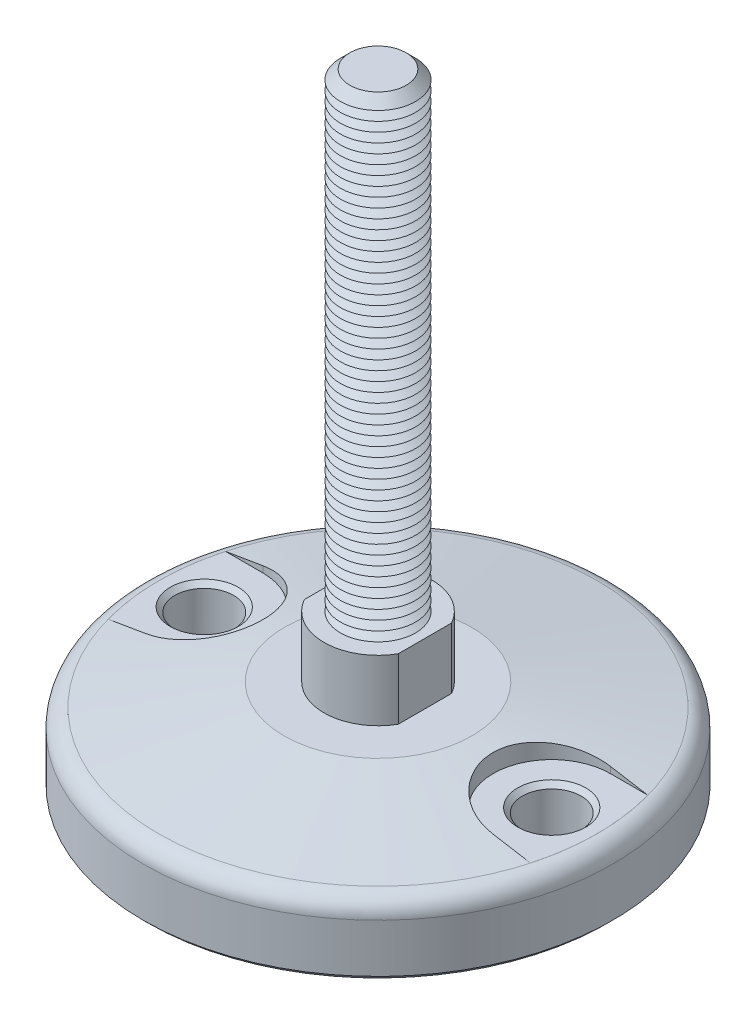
ISO-10303-21;
HEADER;
FILE_DESCRIPTION(('STEP AP214'),'2;1');
FILE_NAME('part.step','',(''),(''),'','','');
FILE_SCHEMA(('AUTOMOTIVE_DESIGN { 1 0 10303 214 1 1 1 1 }'));
ENDSEC;
DATA;
#1=APPLICATION_CONTEXT('core data for automotive mechanical design processes');
#2=APPLICATION_PROTOCOL_DEFINITION('international standard','automotive_design',2000,#1);
#3=PRODUCT_CONTEXT('',#1,'mechanical');
#4=PRODUCT('Part','Part','',(#3));
#5=PRODUCT_RELATED_PRODUCT_CATEGORY('part','',(#4));
#6=PRODUCT_DEFINITION_FORMATION('','',#4);
#7=PRODUCT_DEFINITION_CONTEXT('part definition',#1,'design');
#8=PRODUCT_DEFINITION('design','',#6,#7);
#9=PRODUCT_DEFINITION_SHAPE('','',#8);
#10=(LENGTH_UNIT() NAMED_UNIT(*) SI_UNIT(.MILLI.,.METRE.));
#11=(NAMED_UNIT(*) PLANE_ANGLE_UNIT() SI_UNIT($,.RADIAN.));
#12=(NAMED_UNIT(*) SI_UNIT($,.STERADIAN.) SOLID_ANGLE_UNIT());
#13=UNCERTAINTY_MEASURE_WITH_UNIT(LENGTH_MEASURE(1.E-05),#10,'distance_accuracy_value','');
#14=(GEOMETRIC_REPRESENTATION_CONTEXT(3) GLOBAL_UNCERTAINTY_ASSIGNED_CONTEXT((#13)) GLOBAL_UNIT_ASSIGNED_CONTEXT((#10,
#11,#12)) REPRESENTATION_CONTEXT('',''));
#15=CARTESIAN_POINT('',(0.,0.,0.));
#16=DIRECTION('',(0.,0.,1.));
#17=DIRECTION('',(1.,0.,0.));
#18=AXIS2_PLACEMENT_3D('',#15,#16,#17);
#19=CARTESIAN_POINT('',(0.,0.,0.));
#20=DIRECTION('',(0.,-1.,0.));
#21=DIRECTION('',(0.,0.,-1.));
#22=AXIS2_PLACEMENT_3D('',#19,#20,#21);
#23=CONICAL_SURFACE('',#22,20.,1.39626340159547);
#24=CARTESIAN_POINT('',(-37.0002,-3.35984690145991,12.4999999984));
#25=CARTESIAN_POINT('',(-36.6430801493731,-3.30019612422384,12.5000422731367));
#26=CARTESIAN_POINT('',(-36.286097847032,-3.23978096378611,12.4847089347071));
#27=CARTESIAN_POINT('',(-35.5749710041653,-3.11777545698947,12.423622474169));
#28=CARTESIAN_POINT('',(-35.2208262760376,-3.05618518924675,12.3778713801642));
#29=CARTESIAN_POINT('',(-34.5181114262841,-2.93221424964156,12.2563192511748));
#30=CARTESIAN_POINT('',(-34.1695379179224,-2.8698341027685,12.1805372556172));
#31=CARTESIAN_POINT('',(-33.4802130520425,-2.74463484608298,11.9995028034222));
#32=CARTESIAN_POINT('',(-33.1394616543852,-2.6818157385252,11.8942504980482));
#33=CARTESIAN_POINT('',(-32.4680688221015,-2.55613846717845,11.6549842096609));
#34=CARTESIAN_POINT('',(-32.1374312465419,-2.49328029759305,11.520959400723));
#35=CARTESIAN_POINT('',(-31.4887465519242,-2.36801465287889,11.2251130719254));
#36=CARTESIAN_POINT('',(-31.1706994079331,-2.30560717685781,11.063291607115));
#37=CARTESIAN_POINT('',(-30.54950311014,-2.18176290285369,10.7129930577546));
#38=CARTESIAN_POINT('',(-30.2463517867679,-2.12032596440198,10.524519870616));
#39=CARTESIAN_POINT('',(-29.6570687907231,-1.99897375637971,10.1221856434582));
#40=CARTESIAN_POINT('',(-29.3709370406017,-1.93905847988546,9.90832471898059));
#41=CARTESIAN_POINT('',(-28.8178459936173,-1.82137928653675,9.45673190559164));
#42=CARTESIAN_POINT('',(-28.5508809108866,-1.76361472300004,9.21900727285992));
#43=CARTESIAN_POINT('',(-28.0379874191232,-1.65088194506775,8.72124060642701));
#44=CARTESIAN_POINT('',(-27.7920590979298,-1.5959137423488,8.46119847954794));
#45=CARTESIAN_POINT('',(-27.323055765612,-1.48948182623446,7.9205326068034));
#46=CARTESIAN_POINT('',(-27.0999836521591,-1.43801855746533,7.63990625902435));
#47=CARTESIAN_POINT('',(-26.6784495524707,-1.33936166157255,7.06003375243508));
#48=CARTESIAN_POINT('',(-26.4799872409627,-1.29216797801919,6.76078783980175));
#49=CARTESIAN_POINT('',(-26.1117166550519,-1.20342811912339,6.14986205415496));
#50=CARTESIAN_POINT('',(-25.94156246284,-1.16181519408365,5.83840042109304));
#51=CARTESIAN_POINT('',(-25.628116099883,-1.08426427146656,5.20155792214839));
#52=CARTESIAN_POINT('',(-25.484823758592,-1.04832623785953,4.87617714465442));
#53=CARTESIAN_POINT('',(-25.2263277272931,-0.982857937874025,4.21390178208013));
#54=CARTESIAN_POINT('',(-25.1111175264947,-0.953326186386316,3.87700988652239));
#55=CARTESIAN_POINT('',(-24.9097439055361,-0.901314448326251,3.19412252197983));
#56=CARTESIAN_POINT('',(-24.8235797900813,-0.878834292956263,2.84812727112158));
#57=CARTESIAN_POINT('',(-24.6830159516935,-0.841972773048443,2.15919160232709));
#58=CARTESIAN_POINT('',(-24.6278129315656,-0.827386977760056,1.8164258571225));
#59=CARTESIAN_POINT('',(-24.5460973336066,-0.805742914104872,1.12725695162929));
#60=CARTESIAN_POINT('',(-24.5195842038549,-0.798684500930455,0.78085386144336));
#61=CARTESIAN_POINT('',(-24.4954839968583,-0.792269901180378,0.0870072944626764));
#62=CARTESIAN_POINT('',(-24.4978939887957,-0.79291293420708,-0.260436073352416));
#63=CARTESIAN_POINT('',(-24.5316115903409,-0.801883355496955,-0.953816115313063));
#64=CARTESIAN_POINT('',(-24.5629189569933,-0.810210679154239,-1.29975280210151));
#65=CARTESIAN_POINT('',(-24.6532283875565,-0.834099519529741,-1.98059726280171));
#66=CARTESIAN_POINT('',(-24.7116571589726,-0.849511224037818,-2.31558655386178));
#67=CARTESIAN_POINT('',(-24.8554972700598,-0.887161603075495,-2.97932206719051));
#68=CARTESIAN_POINT('',(-24.9409081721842,-0.909400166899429,-3.30806839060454));
#69=CARTESIAN_POINT('',(-25.1380243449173,-0.96022687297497,-3.95709027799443));
#70=CARTESIAN_POINT('',(-25.2497309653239,-0.988815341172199,-4.27736540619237));
#71=CARTESIAN_POINT('',(-25.498560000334,-1.05177019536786,-4.90729718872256));
#72=CARTESIAN_POINT('',(-25.6356828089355,-1.08613667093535,-5.21695367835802));
#73=CARTESIAN_POINT('',(-25.9361124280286,-1.16046648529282,-5.82730491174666));
#74=CARTESIAN_POINT('',(-26.0997157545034,-1.20049246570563,-6.12784605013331));
#75=CARTESIAN_POINT('',(-26.4506699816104,-1.28514282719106,-6.71404041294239));
#76=CARTESIAN_POINT('',(-26.6380209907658,-1.32976722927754,-6.99969356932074));
#77=CARTESIAN_POINT('',(-27.0351260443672,-1.42294054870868,-7.55431098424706));
#78=CARTESIAN_POINT('',(-27.2448809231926,-1.47148961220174,-7.82327462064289));
#79=CARTESIAN_POINT('',(-27.6853233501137,-1.57185653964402,-8.34282852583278));
#80=CARTESIAN_POINT('',(-27.9160114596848,-1.62367449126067,-8.59341830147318));
#81=CARTESIAN_POINT('',(-28.4034930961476,-1.73144835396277,-9.08142742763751));
#82=CARTESIAN_POINT('',(-28.660837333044,-1.78747956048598,-9.31828026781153));
#83=CARTESIAN_POINT('',(-29.1941741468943,-1.90170822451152,-9.7693949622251));
#84=CARTESIAN_POINT('',(-29.4701671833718,-1.95990573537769,-9.9836562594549));
#85=CARTESIAN_POINT('',(-30.0390002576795,-2.07790752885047,-10.3882796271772));
#86=CARTESIAN_POINT('',(-30.3318471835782,-2.1377124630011,-10.5786318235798));
#87=CARTESIAN_POINT('',(-30.9322646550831,-2.25836853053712,-10.9340888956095));
#88=CARTESIAN_POINT('',(-31.2398348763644,-2.31921964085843,-11.0991943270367));
#89=CARTESIAN_POINT('',(-31.8736774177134,-2.44266131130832,-11.4060146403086));
#90=CARTESIAN_POINT('',(-32.2001962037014,-2.50526276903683,-11.5472162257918));
#91=CARTESIAN_POINT('',(-32.8640586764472,-2.63057186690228,-11.8012839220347));
#92=CARTESIAN_POINT('',(-33.2014023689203,-2.69327950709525,-11.9141500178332));
#93=CARTESIAN_POINT('',(-33.8840988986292,-2.81828940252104,-12.1106227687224));
#94=CARTESIAN_POINT('',(-34.2294411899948,-2.88059206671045,-12.1942658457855));
#95=CARTESIAN_POINT('',(-34.9259788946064,-3.00445494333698,-12.3318436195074));
#96=CARTESIAN_POINT('',(-35.2771713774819,-3.06601550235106,-12.3857927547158));
#97=CARTESIAN_POINT('',(-35.8576122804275,-3.16637163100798,-12.4497947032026));
#98=CARTESIAN_POINT('',(-36.0858729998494,-3.20548751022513,-12.468632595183));
#99=CARTESIAN_POINT('',(-36.5427974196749,-3.2831194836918,-12.4937281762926));
#100=CARTESIAN_POINT('',(-36.7714598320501,-3.32163646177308,-12.5000065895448));
#101=CARTESIAN_POINT('',(-37.0002,-3.35984690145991,-12.4999999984));
#102=B_SPLINE_CURVE_WITH_KNOTS('',3,(#24,#25,#26,#27,#28,#29,#30,#31,#32,#33,#34,#35,#36,#37,
#38,#39,#40,#41,#42,#43,#44,#45,#46,#47,#48,#49,#50,#51,#52,#53,#54,#55,#56,#57,#58,#59,#60,#61,
#62,#63,#64,#65,#66,#67,#68,#69,#70,#71,#72,#73,#74,#75,#76,#77,#78,#79,#80,#81,#82,#83,#84,#85,
#86,#87,#88,#89,#90,#91,#92,#93,#94,#95,#96,#97,#98,#99,#100,#101),.UNSPECIFIED.,.F.,.F.,(4,2,2,
2,2,2,2,2,2,2,2,2,2,2,2,2,2,2,2,2,2,2,2,2,2,2,2,2,2,2,2,2,2,2,2,2,2,2,4),(0.,1.08586245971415,
2.171652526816,3.25675530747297,4.34185251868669,5.42735872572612,6.51286278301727,
7.59820826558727,8.68354880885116,9.76856032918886,10.853576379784,11.9387298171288,
13.0238689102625,14.0945791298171,15.1652825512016,16.2357374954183,17.3061668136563,
18.3473597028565,19.3885325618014,20.4295999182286,21.4706585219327,22.4906487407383,
23.5106224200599,24.5306484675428,25.5506903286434,26.5830642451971,27.6154428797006,
28.6478599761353,29.680304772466,30.7417064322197,31.8031342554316,32.8649990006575,
33.9268403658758,35.0091880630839,36.0915363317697,37.1725307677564,38.2529991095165,
38.9497417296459,39.6453337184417),.UNSPECIFIED.);
#103=CARTESIAN_POINT('',(-37.,-3.35981349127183,12.5));
#104=VERTEX_POINT('',#103);
#105=CARTESIAN_POINT('',(-37.,-3.35981349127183,-12.5));
#106=VERTEX_POINT('',#105);
#107=EDGE_CURVE('E650',#104,#106,#102,.T.);
#108=ORIENTED_EDGE('',*,*,#107,.F.);
#109=CARTESIAN_POINT('',(-61.7266967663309,-7.57847020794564,12.5));
#110=CARTESIAN_POINT('',(-60.2351929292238,-7.320720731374,12.5));
#111=CARTESIAN_POINT('',(-58.7436306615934,-7.06330856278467,12.5));
#112=CARTESIAN_POINT('',(-55.7603527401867,-6.54937673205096,12.5));
#113=CARTESIAN_POINT('',(-54.2686370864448,-6.29285706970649,12.5));
#114=CARTESIAN_POINT('',(-51.2850284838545,-5.78093030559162,12.5));
#115=CARTESIAN_POINT('',(-49.7931355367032,-5.52552319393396,12.5));
#116=CARTESIAN_POINT('',(-46.8091047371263,-5.01613816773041,12.5));
#117=CARTESIAN_POINT('',(-45.3169668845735,-4.76216025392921,12.5));
#118=CARTESIAN_POINT('',(-42.3323589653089,-4.25607669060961,12.5));
#119=CARTESIAN_POINT('',(-40.8398888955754,-4.00397105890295,12.5));
#120=CARTESIAN_POINT('',(-37.8545274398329,-3.50227519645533,12.5));
#121=CARTESIAN_POINT('',(-36.3616360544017,-3.252684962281,12.5));
#122=CARTESIAN_POINT('',(-34.1218562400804,-2.88092207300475,12.5));
#123=CARTESIAN_POINT('',(-33.3751855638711,-2.7574375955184,12.5));
#124=CARTESIAN_POINT('',(-31.8816714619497,-2.51151914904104,12.5));
#125=CARTESIAN_POINT('',(-31.1348280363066,-2.38908517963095,12.5));
#126=CARTESIAN_POINT('',(-29.6409325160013,-2.14547417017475,12.5));
#127=CARTESIAN_POINT('',(-28.8938804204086,-2.024297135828,12.5));
#128=CARTESIAN_POINT('',(-27.3995261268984,-1.78348915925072,12.5));
#129=CARTESIAN_POINT('',(-26.6522239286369,-1.66385821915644,12.5));
#130=CARTESIAN_POINT('',(-25.9047753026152,-1.54514479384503,12.5));
#131=B_SPLINE_CURVE_WITH_KNOTS('',3,(#109,#110,#111,#112,#113,#114,#115,#116,#117,#118,#119,
#120,#121,#122,#123,#124,#125,#126,#127,#128,#129,#130),.UNSPECIFIED.,.F.,.F.,(4,2,2,2,2,2,2,2,
2,2,4),(0.,4.54083339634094,9.08166577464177,13.6224577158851,18.1632520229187,22.7040894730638,
27.2449207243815,29.5153583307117,31.7857950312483,34.0562420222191,36.3266921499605),.UNSPECIFIED.);
#132=CARTESIAN_POINT('',(-44.9493194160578,-4.7,12.5));
#133=VERTEX_POINT('',#132);
#134=EDGE_CURVE('E624',#133,#104,#131,.T.);
#135=ORIENTED_EDGE('',*,*,#134,.F.);
#136=CARTESIAN_POINT('',(0.,-4.7,0.));
#137=DIRECTION('',(0.,1.,0.));
#138=DIRECTION('',(0.,0.,1.));
#139=AXIS2_PLACEMENT_3D('',#136,#137,#138);
#140=CIRCLE('',#139,46.6550245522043);
#141=CARTESIAN_POINT('',(-44.9493194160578,-4.7,-12.5));
#142=VERTEX_POINT('',#141);
#143=EDGE_CURVE('E612',#133,#142,#140,.F.);
#144=ORIENTED_EDGE('',*,*,#143,.T.);
#145=CARTESIAN_POINT('',(-25.9047753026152,-1.54514479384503,-12.5));
#146=CARTESIAN_POINT('',(-26.6522239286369,-1.66385821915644,-12.5));
#147=CARTESIAN_POINT('',(-27.3995261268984,-1.78348915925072,-12.5));
#148=CARTESIAN_POINT('',(-28.8938804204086,-2.024297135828,-12.5));
#149=CARTESIAN_POINT('',(-29.6409325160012,-2.14547417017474,-12.5));
#150=CARTESIAN_POINT('',(-31.1348280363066,-2.38908517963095,-12.5));
#151=CARTESIAN_POINT('',(-31.8816714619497,-2.51151914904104,-12.5));
#152=CARTESIAN_POINT('',(-33.3751855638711,-2.7574375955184,-12.5));
#153=CARTESIAN_POINT('',(-34.1218562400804,-2.88092207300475,-12.5));
#154=CARTESIAN_POINT('',(-36.3616360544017,-3.252684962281,-12.5));
#155=CARTESIAN_POINT('',(-37.8545274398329,-3.50227519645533,-12.5));
#156=CARTESIAN_POINT('',(-40.8398888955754,-4.00397105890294,-12.5));
#157=CARTESIAN_POINT('',(-42.3323589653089,-4.2560766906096,-12.5));
#158=CARTESIAN_POINT('',(-45.3169668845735,-4.7621602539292,-12.5));
#159=CARTESIAN_POINT('',(-46.8091047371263,-5.01613816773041,-12.5));
#160=CARTESIAN_POINT('',(-49.7931355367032,-5.52552319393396,-12.5));
#161=CARTESIAN_POINT('',(-51.2850284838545,-5.78093030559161,-12.5));
#162=CARTESIAN_POINT('',(-54.2686370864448,-6.29285706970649,-12.5));
#163=CARTESIAN_POINT('',(-55.7603527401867,-6.54937673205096,-12.5));
#164=CARTESIAN_POINT('',(-58.7436306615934,-7.06330856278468,-12.5));
#165=CARTESIAN_POINT('',(-60.2351929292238,-7.320720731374,-12.5));
#166=CARTESIAN_POINT('',(-61.7266967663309,-7.57847020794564,-12.5));
#167=B_SPLINE_CURVE_WITH_KNOTS('',3,(#145,#146,#147,#148,#149,#150,#151,#152,#153,#154,#155,
#156,#157,#158,#159,#160,#161,#162,#163,#164,#165,#166),.UNSPECIFIED.,.F.,.F.,(4,2,2,2,2,2,2,2,
2,2,4),(0.,2.27045012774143,4.54089711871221,6.81133381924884,9.08177142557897,13.6226026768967,
18.1634401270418,22.7042344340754,27.2450263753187,31.7858587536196,36.3266921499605),.UNSPECIFIED.);
#168=EDGE_CURVE('E616',#106,#142,#167,.T.);
#169=ORIENTED_EDGE('',*,*,#168,.F.);
#170=EDGE_LOOP('',(#108,#135,#144,#169));
#171=FACE_BOUND('',#170,.T.);
#172=CARTESIAN_POINT('',(0.,-4.70697693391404,0.));
#173=DIRECTION('',(0.,1.,0.));
#174=DIRECTION('',(0.,0.,1.));
#175=AXIS2_PLACEMENT_3D('',#172,#173,#174);
#176=CIRCLE('',#175,46.6945927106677);
#177=CARTESIAN_POINT('',(0.,-4.70697693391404,46.6945927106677));
#178=VERTEX_POINT('',#177);
#179=EDGE_CURVE('E601',#178,#178,#176,.T.);
#180=ORIENTED_EDGE('',*,*,#179,.T.);
#181=EDGE_LOOP('',(#180));
#182=FACE_BOUND('',#181,.T.);
#183=CARTESIAN_POINT('',(0.,0.,0.));
#184=DIRECTION('',(0.,1.,0.));
#185=DIRECTION('',(0.,0.,1.));
#186=AXIS2_PLACEMENT_3D('',#183,#184,#185);
#187=CIRCLE('',#186,20.);
#188=CARTESIAN_POINT('',(0.,0.,20.));
#189=VERTEX_POINT('',#188);
#190=EDGE_CURVE('E597',#189,#189,#187,.T.);
#191=ORIENTED_EDGE('',*,*,#190,.F.);
#192=EDGE_LOOP('',(#191));
#193=FACE_BOUND('',#192,.T.);
#194=CARTESIAN_POINT('',(55.9042883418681,-6.57430258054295,12.5));
#195=CARTESIAN_POINT('',(54.412585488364,-6.31763127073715,12.5));
#196=CARTESIAN_POINT('',(52.9208062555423,-6.06140219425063,12.5));
#197=CARTESIAN_POINT('',(49.9370413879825,-5.55015786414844,12.5));
#198=CARTESIAN_POINT('',(48.4450557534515,-5.29514260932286,12.5));
#199=CARTESIAN_POINT('',(45.4608530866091,-4.78666015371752,12.5));
#200=CARTESIAN_POINT('',(43.9686360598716,-4.53319292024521,12.5));
#201=CARTESIAN_POINT('',(40.9838536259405,-4.02830138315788,12.5));
#202=CARTESIAN_POINT('',(39.4912882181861,-3.7768770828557,12.5));
#203=CARTESIAN_POINT('',(36.50565536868,-3.27679220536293,12.5));
#204=CARTESIAN_POINT('',(35.0125879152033,-3.02813169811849,12.5));
#205=CARTESIAN_POINT('',(32.0258195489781,-2.53467103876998,12.5));
#206=CARTESIAN_POINT('',(30.5321186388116,-2.28987087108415,12.5));
#207=CARTESIAN_POINT('',(28.290865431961,-1.92688841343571,12.5));
#208=CARTESIAN_POINT('',(27.5436550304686,-1.80659579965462,12.5));
#209=CARTESIAN_POINT('',(26.0489572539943,-1.56774876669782,12.5));
#210=CARTESIAN_POINT('',(25.3014698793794,-1.44919434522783,12.5));
#211=CARTESIAN_POINT('',(23.8061486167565,-1.21422016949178,12.5));
#212=CARTESIAN_POINT('',(23.0583147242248,-1.09780044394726,12.5));
#213=CARTESIAN_POINT('',(21.5622260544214,-0.867676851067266,12.5));
#214=CARTESIAN_POINT('',(20.8139712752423,-0.753972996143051,12.5));
#215=CARTESIAN_POINT('',(20.0654672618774,-0.641917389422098,12.5));
#216=B_SPLINE_CURVE_WITH_KNOTS('',3,(#194,#195,#196,#197,#198,#199,#200,#201,#202,#203,#204,
#205,#206,#207,#208,#209,#210,#211,#212,#213,#214,#215),.UNSPECIFIED.,.F.,.F.,(4,2,2,2,2,2,2,2,
2,2,4),(0.,4.54087231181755,9.08174009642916,13.6225116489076,18.1632905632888,22.7041841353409,
27.2450593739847,29.515551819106,31.7860412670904,34.0565612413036,36.3270915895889),.UNSPECIFIED.);
#217=CARTESIAN_POINT('',(44.9493194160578,-4.7,12.5));
#218=VERTEX_POINT('',#217);
#219=CARTESIAN_POINT('',(37.,-3.35981349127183,12.5));
#220=VERTEX_POINT('',#219);
#221=EDGE_CURVE('E120',#218,#220,#216,.T.);
#222=ORIENTED_EDGE('',*,*,#221,.T.);
#223=CARTESIAN_POINT('',(37.0002,-3.35984690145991,12.4999999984));
#224=CARTESIAN_POINT('',(36.6430801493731,-3.30019612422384,12.5000422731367));
#225=CARTESIAN_POINT('',(36.286097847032,-3.23978096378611,12.4847089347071));
#226=CARTESIAN_POINT('',(35.5749710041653,-3.11777545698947,12.423622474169));
#227=CARTESIAN_POINT('',(35.2208262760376,-3.05618518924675,12.3778713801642));
#228=CARTESIAN_POINT('',(34.5181114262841,-2.93221424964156,12.2563192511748));
#229=CARTESIAN_POINT('',(34.1695379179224,-2.8698341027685,12.1805372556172));
#230=CARTESIAN_POINT('',(33.4802130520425,-2.74463484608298,11.9995028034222));
#231=CARTESIAN_POINT('',(33.1394616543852,-2.6818157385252,11.8942504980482));
#232=CARTESIAN_POINT('',(32.4680688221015,-2.55613846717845,11.6549842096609));
#233=CARTESIAN_POINT('',(32.1374312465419,-2.49328029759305,11.520959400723));
#234=CARTESIAN_POINT('',(31.4887465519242,-2.36801465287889,11.2251130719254));
#235=CARTESIAN_POINT('',(31.1706994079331,-2.30560717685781,11.063291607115));
#236=CARTESIAN_POINT('',(30.54950311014,-2.18176290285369,10.7129930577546));
#237=CARTESIAN_POINT('',(30.2463517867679,-2.12032596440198,10.524519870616));
#238=CARTESIAN_POINT('',(29.6570687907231,-1.99897375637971,10.1221856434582));
#239=CARTESIAN_POINT('',(29.3709370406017,-1.93905847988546,9.90832471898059));
#240=CARTESIAN_POINT('',(28.8178459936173,-1.82137928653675,9.45673190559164));
#241=CARTESIAN_POINT('',(28.5508809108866,-1.76361472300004,9.21900727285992));
#242=CARTESIAN_POINT('',(28.0379874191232,-1.65088194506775,8.72124060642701));
#243=CARTESIAN_POINT('',(27.7920590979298,-1.5959137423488,8.46119847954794));
#244=CARTESIAN_POINT('',(27.323055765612,-1.48948182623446,7.9205326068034));
#245=CARTESIAN_POINT('',(27.0999836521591,-1.43801855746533,7.63990625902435));
#246=CARTESIAN_POINT('',(26.6784495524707,-1.33936166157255,7.06003375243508));
#247=CARTESIAN_POINT('',(26.4799872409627,-1.29216797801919,6.76078783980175));
#248=CARTESIAN_POINT('',(26.1117166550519,-1.20342811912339,6.14986205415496));
#249=CARTESIAN_POINT('',(25.94156246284,-1.16181519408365,5.83840042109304));
#250=CARTESIAN_POINT('',(25.628116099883,-1.08426427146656,5.20155792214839));
#251=CARTESIAN_POINT('',(25.484823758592,-1.04832623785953,4.87617714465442));
#252=CARTESIAN_POINT('',(25.2263277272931,-0.982857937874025,4.21390178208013));
#253=CARTESIAN_POINT('',(25.1111175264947,-0.953326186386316,3.87700988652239));
#254=CARTESIAN_POINT('',(24.9097439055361,-0.901314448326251,3.19412252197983));
#255=CARTESIAN_POINT('',(24.8235797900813,-0.878834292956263,2.84812727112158));
#256=CARTESIAN_POINT('',(24.6830159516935,-0.841972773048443,2.15919160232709));
#257=CARTESIAN_POINT('',(24.6278129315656,-0.827386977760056,1.8164258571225));
#258=CARTESIAN_POINT('',(24.5460973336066,-0.805742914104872,1.12725695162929));
#259=CARTESIAN_POINT('',(24.5195842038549,-0.798684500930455,0.78085386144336));
#260=CARTESIAN_POINT('',(24.4954839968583,-0.792269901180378,0.0870072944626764));
#261=CARTESIAN_POINT('',(24.4978939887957,-0.79291293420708,-0.260436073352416));
#262=CARTESIAN_POINT('',(24.5316115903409,-0.801883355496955,-0.953816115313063));
#263=CARTESIAN_POINT('',(24.5629189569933,-0.810210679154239,-1.29975280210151));
#264=CARTESIAN_POINT('',(24.6532283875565,-0.834099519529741,-1.98059726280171));
#265=CARTESIAN_POINT('',(24.7116571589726,-0.849511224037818,-2.31558655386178));
#266=CARTESIAN_POINT('',(24.8554972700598,-0.887161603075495,-2.97932206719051));
#267=CARTESIAN_POINT('',(24.9409081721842,-0.909400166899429,-3.30806839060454));
#268=CARTESIAN_POINT('',(25.1380243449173,-0.96022687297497,-3.95709027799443));
#269=CARTESIAN_POINT('',(25.2497309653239,-0.988815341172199,-4.27736540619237));
#270=CARTESIAN_POINT('',(25.498560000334,-1.05177019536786,-4.90729718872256));
#271=CARTESIAN_POINT('',(25.6356828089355,-1.08613667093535,-5.21695367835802));
#272=CARTESIAN_POINT('',(25.9361124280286,-1.16046648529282,-5.82730491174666));
#273=CARTESIAN_POINT('',(26.0997157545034,-1.20049246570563,-6.12784605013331));
#274=CARTESIAN_POINT('',(26.4506699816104,-1.28514282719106,-6.71404041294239));
#275=CARTESIAN_POINT('',(26.6380209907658,-1.32976722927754,-6.99969356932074));
#276=CARTESIAN_POINT('',(27.0351260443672,-1.42294054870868,-7.55431098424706));
#277=CARTESIAN_POINT('',(27.2448809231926,-1.47148961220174,-7.82327462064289));
#278=CARTESIAN_POINT('',(27.6853233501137,-1.57185653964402,-8.34282852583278));
#279=CARTESIAN_POINT('',(27.9160114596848,-1.62367449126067,-8.59341830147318));
#280=CARTESIAN_POINT('',(28.4034930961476,-1.73144835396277,-9.08142742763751));
#281=CARTESIAN_POINT('',(28.660837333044,-1.78747956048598,-9.31828026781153));
#282=CARTESIAN_POINT('',(29.1941741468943,-1.90170822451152,-9.7693949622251));
#283=CARTESIAN_POINT('',(29.4701671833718,-1.95990573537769,-9.9836562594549));
#284=CARTESIAN_POINT('',(30.0390002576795,-2.07790752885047,-10.3882796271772));
#285=CARTESIAN_POINT('',(30.3318471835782,-2.1377124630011,-10.5786318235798));
#286=CARTESIAN_POINT('',(30.9322646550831,-2.25836853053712,-10.9340888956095));
#287=CARTESIAN_POINT('',(31.2398348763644,-2.31921964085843,-11.0991943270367));
#288=CARTESIAN_POINT('',(31.8736774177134,-2.44266131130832,-11.4060146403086));
#289=CARTESIAN_POINT('',(32.2001962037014,-2.50526276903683,-11.5472162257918));
#290=CARTESIAN_POINT('',(32.8640586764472,-2.63057186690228,-11.8012839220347));
#291=CARTESIAN_POINT('',(33.2014023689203,-2.69327950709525,-11.9141500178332));
#292=CARTESIAN_POINT('',(33.8840988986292,-2.81828940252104,-12.1106227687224));
#293=CARTESIAN_POINT('',(34.2294411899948,-2.88059206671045,-12.1942658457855));
#294=CARTESIAN_POINT('',(34.9259788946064,-3.00445494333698,-12.3318436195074));
#295=CARTESIAN_POINT('',(35.2771713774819,-3.06601550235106,-12.3857927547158));
#296=CARTESIAN_POINT('',(35.8576122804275,-3.16637163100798,-12.4497947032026));
#297=CARTESIAN_POINT('',(36.0858729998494,-3.20548751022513,-12.468632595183));
#298=CARTESIAN_POINT('',(36.5427974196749,-3.2831194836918,-12.4937281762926));
#299=CARTESIAN_POINT('',(36.7714598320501,-3.32163646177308,-12.5000065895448));
#300=CARTESIAN_POINT('',(37.0002,-3.35984690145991,-12.4999999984));
#301=B_SPLINE_CURVE_WITH_KNOTS('',3,(#223,#224,#225,#226,#227,#228,#229,#230,#231,#232,#233,
#234,#235,#236,#237,#238,#239,#240,#241,#242,#243,#244,#245,#246,#247,#248,#249,#250,#251,#252,
#253,#254,#255,#256,#257,#258,#259,#260,#261,#262,#263,#264,#265,#266,#267,#268,#269,#270,#271,
#272,#273,#274,#275,#276,#277,#278,#279,#280,#281,#282,#283,#284,#285,#286,#287,#288,#289,#290,
#291,#292,#293,#294,#295,#296,#297,#298,#299,#300),.UNSPECIFIED.,.F.,.F.,(4,2,2,2,2,2,2,2,2,2,2,
2,2,2,2,2,2,2,2,2,2,2,2,2,2,2,2,2,2,2,2,2,2,2,2,2,2,2,4),(0.,1.08586245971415,2.171652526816,
3.25675530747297,4.34185251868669,5.42735872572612,6.51286278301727,7.59820826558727,
8.68354880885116,9.76856032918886,10.853576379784,11.9387298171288,13.0238689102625,
14.0945791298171,15.1652825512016,16.2357374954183,17.3061668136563,18.3473597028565,
19.3885325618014,20.4295999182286,21.4706585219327,22.4906487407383,23.5106224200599,
24.5306484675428,25.5506903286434,26.5830642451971,27.6154428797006,28.6478599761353,
29.680304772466,30.7417064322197,31.8031342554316,32.8649990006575,33.9268403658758,
35.0091880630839,36.0915363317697,37.1725307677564,38.2529991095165,38.9497417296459,
39.6453337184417),.UNSPECIFIED.);
#302=CARTESIAN_POINT('',(37.,-3.35981349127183,-12.5));
#303=VERTEX_POINT('',#302);
#304=EDGE_CURVE('E132',#220,#303,#301,.T.);
#305=ORIENTED_EDGE('',*,*,#304,.T.);
#306=CARTESIAN_POINT('',(20.0654672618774,-0.641917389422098,-12.5));
#307=CARTESIAN_POINT('',(20.8139712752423,-0.753972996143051,-12.5));
#308=CARTESIAN_POINT('',(21.5622260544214,-0.867676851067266,-12.5));
#309=CARTESIAN_POINT('',(23.0583147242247,-1.09780044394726,-12.5));
#310=CARTESIAN_POINT('',(23.8061486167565,-1.21422016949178,-12.5));
#311=CARTESIAN_POINT('',(25.3014698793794,-1.44919434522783,-12.5));
#312=CARTESIAN_POINT('',(26.0489572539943,-1.56774876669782,-12.5));
#313=CARTESIAN_POINT('',(27.5436550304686,-1.80659579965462,-12.5));
#314=CARTESIAN_POINT('',(28.290865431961,-1.92688841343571,-12.5));
#315=CARTESIAN_POINT('',(30.5321186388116,-2.28987087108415,-12.5));
#316=CARTESIAN_POINT('',(32.0258195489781,-2.53467103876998,-12.5));
#317=CARTESIAN_POINT('',(35.0125879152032,-3.02813169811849,-12.5));
#318=CARTESIAN_POINT('',(36.50565536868,-3.27679220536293,-12.5));
#319=CARTESIAN_POINT('',(39.4912882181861,-3.7768770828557,-12.5));
#320=CARTESIAN_POINT('',(40.9838536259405,-4.02830138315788,-12.5));
#321=CARTESIAN_POINT('',(43.9686360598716,-4.53319292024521,-12.5));
#322=CARTESIAN_POINT('',(45.4608530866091,-4.78666015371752,-12.5));
#323=CARTESIAN_POINT('',(48.4450557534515,-5.29514260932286,-12.5));
#324=CARTESIAN_POINT('',(49.9370413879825,-5.55015786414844,-12.5));
#325=CARTESIAN_POINT('',(52.9208062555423,-6.06140219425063,-12.5));
#326=CARTESIAN_POINT('',(54.412585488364,-6.31763127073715,-12.5));
#327=CARTESIAN_POINT('',(55.9042883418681,-6.57430258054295,-12.5));
#328=B_SPLINE_CURVE_WITH_KNOTS('',3,(#306,#307,#308,#309,#310,#311,#312,#313,#314,#315,#316,
#317,#318,#319,#320,#321,#322,#323,#324,#325,#326,#327),.UNSPECIFIED.,.F.,.F.,(4,2,2,2,2,2,2,2,
2,2,4),(0.,2.27053034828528,4.54105032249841,6.81153977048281,9.08203221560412,13.6229074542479,
18.1638010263,22.7045799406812,27.2453514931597,31.7862192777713,36.3270915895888),.UNSPECIFIED.);
#329=CARTESIAN_POINT('',(44.9493194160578,-4.7,-12.5));
#330=VERTEX_POINT('',#329);
#331=EDGE_CURVE('E680',#303,#330,#328,.T.);
#332=ORIENTED_EDGE('',*,*,#331,.T.);
#333=CARTESIAN_POINT('',(0.,-4.7,0.));
#334=DIRECTION('',(0.,1.,0.));
#335=DIRECTION('',(0.,0.,1.));
#336=AXIS2_PLACEMENT_3D('',#333,#334,#335);
#337=CIRCLE('',#336,46.6550245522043);
#338=EDGE_CURVE('E672',#330,#218,#337,.F.);
#339=ORIENTED_EDGE('',*,*,#338,.T.);
#340=EDGE_LOOP('',(#222,#305,#332,#339));
#341=FACE_BOUND('',#340,.T.);
#342=ADVANCED_FACE('F38',(#171,#182,#193,#341),#23,.T.);
#343=CARTESIAN_POINT('',(0.,13.,0.));
#344=DIRECTION('',(0.,-1.,0.));
#345=DIRECTION('',(0.,0.,-1.));
#346=AXIS2_PLACEMENT_3D('',#343,#344,#345);
#347=CYLINDRICAL_SURFACE('',#346,11.5);
#348=CARTESIAN_POINT('',(0.,13.,0.));
#349=DIRECTION('',(0.,1.,0.));
#350=DIRECTION('',(0.,0.,1.));
#351=AXIS2_PLACEMENT_3D('',#348,#349,#350);
#352=CIRCLE('',#351,11.5);
#353=CARTESIAN_POINT('',(-10.,13.,5.67890834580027));
#354=VERTEX_POINT('',#353);
#355=CARTESIAN_POINT('',(10.,13.,5.67890834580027));
#356=VERTEX_POINT('',#355);
#357=EDGE_CURVE('E572',#354,#356,#352,.T.);
#358=ORIENTED_EDGE('',*,*,#357,.F.);
#359=DIRECTION('',(0.,1.,0.));
#360=VECTOR('',#359,1.);
#361=CARTESIAN_POINT('',(-10.,0.,5.67890834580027));
#362=LINE('',#361,#360);
#363=CARTESIAN_POINT('',(-10.,0.,5.67890834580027));
#364=VERTEX_POINT('',#363);
#365=EDGE_CURVE('E563',#364,#354,#362,.T.);
#366=ORIENTED_EDGE('',*,*,#365,.F.);
#367=CARTESIAN_POINT('',(0.,0.,0.));
#368=DIRECTION('',(0.,1.,0.));
#369=DIRECTION('',(0.,0.,1.));
#370=AXIS2_PLACEMENT_3D('',#367,#368,#369);
#371=CIRCLE('',#370,11.5);
#372=CARTESIAN_POINT('',(10.,0.,5.67890834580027));
#373=VERTEX_POINT('',#372);
#374=EDGE_CURVE('E591',#364,#373,#371,.T.);
#375=ORIENTED_EDGE('',*,*,#374,.T.);
#376=DIRECTION('',(0.,1.,0.));
#377=VECTOR('',#376,1.);
#378=CARTESIAN_POINT('',(10.,0.,5.67890834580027));
#379=LINE('',#378,#377);
#380=EDGE_CURVE('E567',#373,#356,#379,.T.);
#381=ORIENTED_EDGE('',*,*,#380,.T.);
#382=EDGE_LOOP('',(#358,#366,#375,#381));
#383=FACE_BOUND('',#382,.T.);
#384=ADVANCED_FACE('F734',(#383),#347,.T.);
#385=CARTESIAN_POINT('',(0.,0.,0.));
#386=DIRECTION('',(0.,1.,0.));
#387=DIRECTION('',(0.,0.,1.));
#388=AXIS2_PLACEMENT_3D('',#385,#386,#387);
#389=PLANE('',#388);
#390=CARTESIAN_POINT('',(10.,0.,-5.67890834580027));
#391=VERTEX_POINT('',#390);
#392=CARTESIAN_POINT('',(-10.,0.,-5.67890834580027));
#393=VERTEX_POINT('',#392);
#394=EDGE_CURVE('E595',#391,#393,#371,.T.);
#395=ORIENTED_EDGE('',*,*,#394,.F.);
#396=DIRECTION('',(0.,0.,1.));
#397=VECTOR('',#396,1.);
#398=CARTESIAN_POINT('',(10.,0.,5.67890834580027));
#399=LINE('',#398,#397);
#400=EDGE_CURVE('E575',#391,#373,#399,.T.);
#401=ORIENTED_EDGE('',*,*,#400,.T.);
#402=ORIENTED_EDGE('',*,*,#374,.F.);
#403=DIRECTION('',(0.,0.,-1.));
#404=VECTOR('',#403,1.);
#405=CARTESIAN_POINT('',(-10.,0.,-5.67890834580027));
#406=LINE('',#405,#404);
#407=EDGE_CURVE('E559',#364,#393,#406,.T.);
#408=ORIENTED_EDGE('',*,*,#407,.T.);
#409=EDGE_LOOP('',(#395,#401,#402,#408));
#410=FACE_BOUND('',#409,.T.);
#411=ORIENTED_EDGE('',*,*,#190,.T.);
#412=EDGE_LOOP('',(#411));
#413=FACE_BOUND('',#412,.T.);
#414=ADVANCED_FACE('F739',(#410,#413),#389,.T.);
#415=CARTESIAN_POINT('',(0.,61.3388655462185,0.));
#416=DIRECTION('',(0.,1.,0.));
#417=DIRECTION('',(0.,0.,1.));
#418=AXIS2_PLACEMENT_3D('',#415,#416,#417);
#419=CYLINDRICAL_SURFACE('',#418,50.);
#420=CARTESIAN_POINT('',(0.,-19.,0.));
#421=DIRECTION('',(0.,-1.,0.));
#422=DIRECTION('',(0.,0.,-1.));
#423=AXIS2_PLACEMENT_3D('',#420,#421,#422);
#424=CIRCLE('',#423,50.);
#425=CARTESIAN_POINT('',(0.,-19.,-50.));
#426=VERTEX_POINT('',#425);
#427=EDGE_CURVE('E47',#426,#426,#424,.F.);
#428=ORIENTED_EDGE('',*,*,#427,.T.);
#429=EDGE_LOOP('',(#428));
#430=FACE_BOUND('',#429,.T.);
#431=CARTESIAN_POINT('',(0.,-8.64620794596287,0.));
#432=DIRECTION('',(0.,-1.,0.));
#433=DIRECTION('',(0.,0.,-1.));
#434=AXIS2_PLACEMENT_3D('',#431,#432,#433);
#435=CIRCLE('',#434,50.);
#436=CARTESIAN_POINT('',(0.,-8.64620794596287,-50.));
#437=VERTEX_POINT('',#436);
#438=EDGE_CURVE('E596',#437,#437,#435,.T.);
#439=ORIENTED_EDGE('',*,*,#438,.T.);
#440=EDGE_LOOP('',(#439));
#441=FACE_BOUND('',#440,.T.);
#442=ADVANCED_FACE('F721',(#430,#441),#419,.T.);
#443=CARTESIAN_POINT('',(0.,-20.,50.));
#444=DIRECTION('',(0.,-1.,0.));
#445=DIRECTION('',(0.,0.,-1.));
#446=AXIS2_PLACEMENT_3D('',#443,#444,#445);
#447=PLANE('',#446);
#448=CARTESIAN_POINT('',(0.,-20.,0.));
#449=DIRECTION('',(0.,-1.,0.));
#450=DIRECTION('',(0.,0.,-1.));
#451=AXIS2_PLACEMENT_3D('',#448,#449,#450);
#452=CIRCLE('',#451,49.);
#453=CARTESIAN_POINT('',(0.,-20.,-49.));
#454=VERTEX_POINT('',#453);
#455=EDGE_CURVE('E11',#454,#454,#452,.T.);
#456=ORIENTED_EDGE('',*,*,#455,.T.);
#457=EDGE_LOOP('',(#456));
#458=FACE_BOUND('',#457,.T.);
#459=CARTESIAN_POINT('',(37.,-20.,0.));
#460=DIRECTION('',(0.,-1.,0.));
#461=DIRECTION('',(0.,0.,-1.));
#462=AXIS2_PLACEMENT_3D('',#459,#460,#461);
#463=CIRCLE('',#462,7.25000000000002);
#464=CARTESIAN_POINT('',(37.,-20.,-7.25000000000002));
#465=VERTEX_POINT('',#464);
#466=EDGE_CURVE('E710',#465,#465,#463,.F.);
#467=ORIENTED_EDGE('',*,*,#466,.T.);
#468=EDGE_LOOP('',(#467));
#469=FACE_BOUND('',#468,.T.);
#470=CARTESIAN_POINT('',(-37.,-20.,0.));
#471=DIRECTION('',(0.,-1.,0.));
#472=DIRECTION('',(0.,0.,-1.));
#473=AXIS2_PLACEMENT_3D('',#470,#471,#472);
#474=CIRCLE('',#473,7.25000000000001);
#475=CARTESIAN_POINT('',(-37.,-20.,-7.25000000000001));
#476=VERTEX_POINT('',#475);
#477=EDGE_CURVE('E656',#476,#476,#474,.F.);
#478=ORIENTED_EDGE('',*,*,#477,.T.);
#479=EDGE_LOOP('',(#478));
#480=FACE_BOUND('',#479,.T.);
#481=ADVANCED_FACE('F789',(#458,#469,#480),#447,.T.);
#482=CARTESIAN_POINT('',(0.,-8.64620794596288,0.));
#483=DIRECTION('',(0.,-1.,0.));
#484=DIRECTION('',(0.,0.,-1.));
#485=AXIS2_PLACEMENT_3D('',#482,#483,#484);
#486=TOROIDAL_SURFACE('',#485,46.,4.);
#487=ORIENTED_EDGE('',*,*,#438,.F.);
#488=EDGE_LOOP('',(#487));
#489=FACE_BOUND('',#488,.T.);
#490=ORIENTED_EDGE('',*,*,#179,.F.);
#491=EDGE_LOOP('',(#490));
#492=FACE_BOUND('',#491,.T.);
#493=ADVANCED_FACE('F788',(#489,#492),#486,.T.);
#494=ORIENTED_EDGE('',*,*,#394,.T.);
#495=DIRECTION('',(0.,1.,0.));
#496=VECTOR('',#495,1.);
#497=CARTESIAN_POINT('',(-10.,0.,-5.67890834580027));
#498=LINE('',#497,#496);
#499=CARTESIAN_POINT('',(-10.,13.,-5.67890834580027));
#500=VERTEX_POINT('',#499);
#501=EDGE_CURVE('E568',#393,#500,#498,.T.);
#502=ORIENTED_EDGE('',*,*,#501,.T.);
#503=CARTESIAN_POINT('',(10.,13.,-5.67890834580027));
#504=VERTEX_POINT('',#503);
#505=EDGE_CURVE('E590',#504,#500,#352,.T.);
#506=ORIENTED_EDGE('',*,*,#505,.F.);
#507=DIRECTION('',(0.,1.,0.));
#508=VECTOR('',#507,1.);
#509=CARTESIAN_POINT('',(10.,0.,-5.67890834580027));
#510=LINE('',#509,#508);
#511=EDGE_CURVE('E579',#391,#504,#510,.T.);
#512=ORIENTED_EDGE('',*,*,#511,.F.);
#513=EDGE_LOOP('',(#494,#502,#506,#512));
#514=FACE_BOUND('',#513,.T.);
#515=ADVANCED_FACE('F742',(#514),#347,.T.);
#516=CARTESIAN_POINT('',(0.,13.,0.));
#517=DIRECTION('',(0.,1.,0.));
#518=DIRECTION('',(0.,0.,1.));
#519=AXIS2_PLACEMENT_3D('',#516,#517,#518);
#520=PLANE('',#519);
#521=CARTESIAN_POINT('',(0.,13.,0.));
#522=DIRECTION('',(0.,1.,0.));
#523=DIRECTION('',(0.,0.,1.));
#524=AXIS2_PLACEMENT_3D('',#521,#522,#523);
#525=CIRCLE('',#524,8.);
#526=CARTESIAN_POINT('',(0.,13.,8.));
#527=VERTEX_POINT('',#526);
#528=EDGE_CURVE('E554',#527,#527,#525,.T.);
#529=ORIENTED_EDGE('',*,*,#528,.F.);
#530=EDGE_LOOP('',(#529));
#531=FACE_BOUND('',#530,.T.);
#532=DIRECTION('',(0.,0.,-1.));
#533=VECTOR('',#532,1.);
#534=CARTESIAN_POINT('',(-10.,13.,-5.67890834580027));
#535=LINE('',#534,#533);
#536=EDGE_CURVE('E564',#354,#500,#535,.T.);
#537=ORIENTED_EDGE('',*,*,#536,.F.);
#538=ORIENTED_EDGE('',*,*,#357,.T.);
#539=DIRECTION('',(0.,0.,1.));
#540=VECTOR('',#539,1.);
#541=CARTESIAN_POINT('',(10.,13.,5.67890834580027));
#542=LINE('',#541,#540);
#543=EDGE_CURVE('E558',#504,#356,#542,.T.);
#544=ORIENTED_EDGE('',*,*,#543,.F.);
#545=ORIENTED_EDGE('',*,*,#505,.T.);
#546=EDGE_LOOP('',(#537,#538,#544,#545));
#547=FACE_BOUND('',#546,.T.);
#548=ADVANCED_FACE('F772',(#531,#547),#520,.T.);
#549=CARTESIAN_POINT('',(10.,0.,5.67890834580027));
#550=DIRECTION('',(-1.,0.,0.));
#551=DIRECTION('',(0.,0.,1.));
#552=AXIS2_PLACEMENT_3D('',#549,#550,#551);
#553=PLANE('',#552);
#554=ORIENTED_EDGE('',*,*,#543,.T.);
#555=ORIENTED_EDGE('',*,*,#380,.F.);
#556=ORIENTED_EDGE('',*,*,#400,.F.);
#557=ORIENTED_EDGE('',*,*,#511,.T.);
#558=EDGE_LOOP('',(#554,#555,#556,#557));
#559=FACE_BOUND('',#558,.T.);
#560=ADVANCED_FACE('F774',(#559),#553,.F.);
#561=CARTESIAN_POINT('',(-10.,0.,-5.67890834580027));
#562=DIRECTION('',(1.,0.,0.));
#563=DIRECTION('',(0.,0.,-1.));
#564=AXIS2_PLACEMENT_3D('',#561,#562,#563);
#565=PLANE('',#564);
#566=ORIENTED_EDGE('',*,*,#536,.T.);
#567=ORIENTED_EDGE('',*,*,#501,.F.);
#568=ORIENTED_EDGE('',*,*,#407,.F.);
#569=ORIENTED_EDGE('',*,*,#365,.T.);
#570=EDGE_LOOP('',(#566,#567,#568,#569));
#571=FACE_BOUND('',#570,.T.);
#572=ADVANCED_FACE('F767',(#571),#565,.F.);
#573=CARTESIAN_POINT('',(0.,13.,0.));
#574=DIRECTION('',(0.,-1.,0.));
#575=DIRECTION('',(0.,0.,-1.));
#576=AXIS2_PLACEMENT_3D('',#573,#574,#575);
#577=CONICAL_SURFACE('',#576,8.,1.0471975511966);
#578=CARTESIAN_POINT('',(0.,14.,0.));
#579=DIRECTION('',(0.,1.,0.));
#580=DIRECTION('',(0.,0.,1.));
#581=AXIS2_PLACEMENT_3D('',#578,#579,#580);
#582=CIRCLE('',#581,6.26794919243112);
#583=CARTESIAN_POINT('',(0.,14.,6.26794919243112));
#584=VERTEX_POINT('',#583);
#585=EDGE_CURVE('E550',#584,#584,#582,.T.);
#586=ORIENTED_EDGE('',*,*,#585,.F.);
#587=EDGE_LOOP('',(#586));
#588=FACE_BOUND('',#587,.T.);
#589=ORIENTED_EDGE('',*,*,#528,.T.);
#590=EDGE_LOOP('',(#589));
#591=FACE_BOUND('',#590,.T.);
#592=ADVANCED_FACE('F781',(#588,#591),#577,.T.);
#593=CARTESIAN_POINT('',(0.,14.,0.));
#594=DIRECTION('',(0.,1.,0.));
#595=DIRECTION('',(0.,0.,1.));
#596=AXIS2_PLACEMENT_3D('',#593,#594,#595);
#597=CONICAL_SURFACE('',#596,6.26794919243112,1.0471975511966);
#598=CARTESIAN_POINT('',(0.,15.,0.));
#599=DIRECTION('',(0.,1.,0.));
#600=DIRECTION('',(0.,0.,1.));
#601=AXIS2_PLACEMENT_3D('',#598,#599,#600);
#602=CIRCLE('',#601,8.);
#603=CARTESIAN_POINT('',(0.,15.,8.));
#604=VERTEX_POINT('',#603);
#605=EDGE_CURVE('E546',#604,#604,#602,.T.);
#606=ORIENTED_EDGE('',*,*,#605,.F.);
#607=EDGE_LOOP('',(#606));
#608=FACE_BOUND('',#607,.T.);
#609=ORIENTED_EDGE('',*,*,#585,.T.);
#610=EDGE_LOOP('',(#609));
#611=FACE_BOUND('',#610,.T.);
#612=ADVANCED_FACE('F1619',(#608,#611),#597,.T.);
#613=CARTESIAN_POINT('',(0.,15.,0.));
#614=DIRECTION('',(0.,-1.,0.));
#615=DIRECTION('',(0.,0.,-1.));
#616=AXIS2_PLACEMENT_3D('',#613,#614,#615);
#617=CONICAL_SURFACE('',#616,8.,1.0471975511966);
#618=CARTESIAN_POINT('',(0.,16.,0.));
#619=DIRECTION('',(0.,1.,0.));
#620=DIRECTION('',(0.,0.,1.));
#621=AXIS2_PLACEMENT_3D('',#618,#619,#620);
#622=CIRCLE('',#621,6.26794919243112);
#623=CARTESIAN_POINT('',(0.,16.,6.26794919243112));
#624=VERTEX_POINT('',#623);
#625=EDGE_CURVE('E542',#624,#624,#622,.T.);
#626=ORIENTED_EDGE('',*,*,#625,.F.);
#627=EDGE_LOOP('',(#626));
#628=FACE_BOUND('',#627,.T.);
#629=ORIENTED_EDGE('',*,*,#605,.T.);
#630=EDGE_LOOP('',(#629));
#631=FACE_BOUND('',#630,.T.);
#632=ADVANCED_FACE('F1612',(#628,#631),#617,.T.);
#633=CARTESIAN_POINT('',(0.,16.,0.));
#634=DIRECTION('',(0.,1.,0.));
#635=DIRECTION('',(0.,0.,1.));
#636=AXIS2_PLACEMENT_3D('',#633,#634,#635);
#637=CONICAL_SURFACE('',#636,6.26794919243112,1.0471975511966);
#638=CARTESIAN_POINT('',(0.,17.,0.));
#639=DIRECTION('',(0.,1.,0.));
#640=DIRECTION('',(0.,0.,1.));
#641=AXIS2_PLACEMENT_3D('',#638,#639,#640);
#642=CIRCLE('',#641,8.);
#643=CARTESIAN_POINT('',(0.,17.,8.));
#644=VERTEX_POINT('',#643);
#645=EDGE_CURVE('E538',#644,#644,#642,.T.);
#646=ORIENTED_EDGE('',*,*,#645,.F.);
#647=EDGE_LOOP('',(#646));
#648=FACE_BOUND('',#647,.T.);
#649=ORIENTED_EDGE('',*,*,#625,.T.);
#650=EDGE_LOOP('',(#649));
#651=FACE_BOUND('',#650,.T.);
#652=ADVANCED_FACE('F1605',(#648,#651),#637,.T.);
#653=CARTESIAN_POINT('',(0.,17.,0.));
#654=DIRECTION('',(0.,-1.,0.));
#655=DIRECTION('',(0.,0.,-1.));
#656=AXIS2_PLACEMENT_3D('',#653,#654,#655);
#657=CONICAL_SURFACE('',#656,8.,1.0471975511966);
#658=CARTESIAN_POINT('',(0.,18.,0.));
#659=DIRECTION('',(0.,1.,0.));
#660=DIRECTION('',(0.,0.,1.));
#661=AXIS2_PLACEMENT_3D('',#658,#659,#660);
#662=CIRCLE('',#661,6.26794919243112);
#663=CARTESIAN_POINT('',(0.,18.,6.26794919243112));
#664=VERTEX_POINT('',#663);
#665=EDGE_CURVE('E534',#664,#664,#662,.T.);
#666=ORIENTED_EDGE('',*,*,#665,.F.);
#667=EDGE_LOOP('',(#666));
#668=FACE_BOUND('',#667,.T.);
#669=ORIENTED_EDGE('',*,*,#645,.T.);
#670=EDGE_LOOP('',(#669));
#671=FACE_BOUND('',#670,.T.);
#672=ADVANCED_FACE('F1598',(#668,#671),#657,.T.);
#673=CARTESIAN_POINT('',(0.,18.,0.));
#674=DIRECTION('',(0.,1.,0.));
#675=DIRECTION('',(0.,0.,1.));
#676=AXIS2_PLACEMENT_3D('',#673,#674,#675);
#677=CONICAL_SURFACE('',#676,6.26794919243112,1.0471975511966);
#678=CARTESIAN_POINT('',(0.,19.,0.));
#679=DIRECTION('',(0.,1.,0.));
#680=DIRECTION('',(0.,0.,1.));
#681=AXIS2_PLACEMENT_3D('',#678,#679,#680);
#682=CIRCLE('',#681,8.);
#683=CARTESIAN_POINT('',(0.,19.,8.));
#684=VERTEX_POINT('',#683);
#685=EDGE_CURVE('E530',#684,#684,#682,.T.);
#686=ORIENTED_EDGE('',*,*,#685,.F.);
#687=EDGE_LOOP('',(#686));
#688=FACE_BOUND('',#687,.T.);
#689=ORIENTED_EDGE('',*,*,#665,.T.);
#690=EDGE_LOOP('',(#689));
#691=FACE_BOUND('',#690,.T.);
#692=ADVANCED_FACE('F1591',(#688,#691),#677,.T.);
#693=CARTESIAN_POINT('',(0.,19.,0.));
#694=DIRECTION('',(0.,-1.,0.));
#695=DIRECTION('',(0.,0.,-1.));
#696=AXIS2_PLACEMENT_3D('',#693,#694,#695);
#697=CONICAL_SURFACE('',#696,8.,1.0471975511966);
#698=CARTESIAN_POINT('',(0.,20.,0.));
#699=DIRECTION('',(0.,1.,0.));
#700=DIRECTION('',(0.,0.,1.));
#701=AXIS2_PLACEMENT_3D('',#698,#699,#700);
#702=CIRCLE('',#701,6.26794919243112);
#703=CARTESIAN_POINT('',(0.,20.,6.26794919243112));
#704=VERTEX_POINT('',#703);
#705=EDGE_CURVE('E526',#704,#704,#702,.T.);
#706=ORIENTED_EDGE('',*,*,#705,.F.);
#707=EDGE_LOOP('',(#706));
#708=FACE_BOUND('',#707,.T.);
#709=ORIENTED_EDGE('',*,*,#685,.T.);
#710=EDGE_LOOP('',(#709));
#711=FACE_BOUND('',#710,.T.);
#712=ADVANCED_FACE('F1584',(#708,#711),#697,.T.);
#713=CARTESIAN_POINT('',(0.,20.,0.));
#714=DIRECTION('',(0.,1.,0.));
#715=DIRECTION('',(0.,0.,1.));
#716=AXIS2_PLACEMENT_3D('',#713,#714,#715);
#717=CONICAL_SURFACE('',#716,6.26794919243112,1.0471975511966);
#718=CARTESIAN_POINT('',(0.,21.,0.));
#719=DIRECTION('',(0.,1.,0.));
#720=DIRECTION('',(0.,0.,1.));
#721=AXIS2_PLACEMENT_3D('',#718,#719,#720);
#722=CIRCLE('',#721,8.);
#723=CARTESIAN_POINT('',(0.,21.,8.));
#724=VERTEX_POINT('',#723);
#725=EDGE_CURVE('E522',#724,#724,#722,.T.);
#726=ORIENTED_EDGE('',*,*,#725,.F.);
#727=EDGE_LOOP('',(#726));
#728=FACE_BOUND('',#727,.T.);
#729=ORIENTED_EDGE('',*,*,#705,.T.);
#730=EDGE_LOOP('',(#729));
#731=FACE_BOUND('',#730,.T.);
#732=ADVANCED_FACE('F1577',(#728,#731),#717,.T.);
#733=CARTESIAN_POINT('',(0.,21.,0.));
#734=DIRECTION('',(0.,-1.,0.));
#735=DIRECTION('',(0.,0.,-1.));
#736=AXIS2_PLACEMENT_3D('',#733,#734,#735);
#737=CONICAL_SURFACE('',#736,8.,1.0471975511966);
#738=CARTESIAN_POINT('',(0.,22.,0.));
#739=DIRECTION('',(0.,1.,0.));
#740=DIRECTION('',(0.,0.,1.));
#741=AXIS2_PLACEMENT_3D('',#738,#739,#740);
#742=CIRCLE('',#741,6.26794919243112);
#743=CARTESIAN_POINT('',(0.,22.,6.26794919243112));
#744=VERTEX_POINT('',#743);
#745=EDGE_CURVE('E518',#744,#744,#742,.T.);
#746=ORIENTED_EDGE('',*,*,#745,.F.);
#747=EDGE_LOOP('',(#746));
#748=FACE_BOUND('',#747,.T.);
#749=ORIENTED_EDGE('',*,*,#725,.T.);
#750=EDGE_LOOP('',(#749));
#751=FACE_BOUND('',#750,.T.);
#752=ADVANCED_FACE('F1570',(#748,#751),#737,.T.);
#753=CARTESIAN_POINT('',(0.,22.,0.));
#754=DIRECTION('',(0.,1.,0.));
#755=DIRECTION('',(0.,0.,1.));
#756=AXIS2_PLACEMENT_3D('',#753,#754,#755);
#757=CONICAL_SURFACE('',#756,6.26794919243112,1.0471975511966);
#758=CARTESIAN_POINT('',(0.,23.,0.));
#759=DIRECTION('',(0.,1.,0.));
#760=DIRECTION('',(0.,0.,1.));
#761=AXIS2_PLACEMENT_3D('',#758,#759,#760);
#762=CIRCLE('',#761,8.);
#763=CARTESIAN_POINT('',(0.,23.,8.));
#764=VERTEX_POINT('',#763);
#765=EDGE_CURVE('E514',#764,#764,#762,.T.);
#766=ORIENTED_EDGE('',*,*,#765,.F.);
#767=EDGE_LOOP('',(#766));
#768=FACE_BOUND('',#767,.T.);
#769=ORIENTED_EDGE('',*,*,#745,.T.);
#770=EDGE_LOOP('',(#769));
#771=FACE_BOUND('',#770,.T.);
#772=ADVANCED_FACE('F1563',(#768,#771),#757,.T.);
#773=CARTESIAN_POINT('',(0.,23.,0.));
#774=DIRECTION('',(0.,-1.,0.));
#775=DIRECTION('',(0.,0.,-1.));
#776=AXIS2_PLACEMENT_3D('',#773,#774,#775);
#777=CONICAL_SURFACE('',#776,8.,1.0471975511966);
#778=CARTESIAN_POINT('',(0.,24.,0.));
#779=DIRECTION('',(0.,1.,0.));
#780=DIRECTION('',(0.,0.,1.));
#781=AXIS2_PLACEMENT_3D('',#778,#779,#780);
#782=CIRCLE('',#781,6.26794919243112);
#783=CARTESIAN_POINT('',(0.,24.,6.26794919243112));
#784=VERTEX_POINT('',#783);
#785=EDGE_CURVE('E510',#784,#784,#782,.T.);
#786=ORIENTED_EDGE('',*,*,#785,.F.);
#787=EDGE_LOOP('',(#786));
#788=FACE_BOUND('',#787,.T.);
#789=ORIENTED_EDGE('',*,*,#765,.T.);
#790=EDGE_LOOP('',(#789));
#791=FACE_BOUND('',#790,.T.);
#792=ADVANCED_FACE('F1556',(#788,#791),#777,.T.);
#793=CARTESIAN_POINT('',(0.,24.,0.));
#794=DIRECTION('',(0.,1.,0.));
#795=DIRECTION('',(0.,0.,1.));
#796=AXIS2_PLACEMENT_3D('',#793,#794,#795);
#797=CONICAL_SURFACE('',#796,6.26794919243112,1.0471975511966);
#798=CARTESIAN_POINT('',(0.,25.,0.));
#799=DIRECTION('',(0.,1.,0.));
#800=DIRECTION('',(0.,0.,1.));
#801=AXIS2_PLACEMENT_3D('',#798,#799,#800);
#802=CIRCLE('',#801,8.);
#803=CARTESIAN_POINT('',(0.,25.,8.));
#804=VERTEX_POINT('',#803);
#805=EDGE_CURVE('E506',#804,#804,#802,.T.);
#806=ORIENTED_EDGE('',*,*,#805,.F.);
#807=EDGE_LOOP('',(#806));
#808=FACE_BOUND('',#807,.T.);
#809=ORIENTED_EDGE('',*,*,#785,.T.);
#810=EDGE_LOOP('',(#809));
#811=FACE_BOUND('',#810,.T.);
#812=ADVANCED_FACE('F1549',(#808,#811),#797,.T.);
#813=CARTESIAN_POINT('',(0.,25.,0.));
#814=DIRECTION('',(0.,-1.,0.));
#815=DIRECTION('',(0.,0.,-1.));
#816=AXIS2_PLACEMENT_3D('',#813,#814,#815);
#817=CONICAL_SURFACE('',#816,8.,1.0471975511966);
#818=CARTESIAN_POINT('',(0.,26.,0.));
#819=DIRECTION('',(0.,1.,0.));
#820=DIRECTION('',(0.,0.,1.));
#821=AXIS2_PLACEMENT_3D('',#818,#819,#820);
#822=CIRCLE('',#821,6.26794919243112);
#823=CARTESIAN_POINT('',(0.,26.,6.26794919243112));
#824=VERTEX_POINT('',#823);
#825=EDGE_CURVE('E502',#824,#824,#822,.T.);
#826=ORIENTED_EDGE('',*,*,#825,.F.);
#827=EDGE_LOOP('',(#826));
#828=FACE_BOUND('',#827,.T.);
#829=ORIENTED_EDGE('',*,*,#805,.T.);
#830=EDGE_LOOP('',(#829));
#831=FACE_BOUND('',#830,.T.);
#832=ADVANCED_FACE('F1542',(#828,#831),#817,.T.);
#833=CARTESIAN_POINT('',(0.,26.,0.));
#834=DIRECTION('',(0.,1.,0.));
#835=DIRECTION('',(0.,0.,1.));
#836=AXIS2_PLACEMENT_3D('',#833,#834,#835);
#837=CONICAL_SURFACE('',#836,6.26794919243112,1.0471975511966);
#838=CARTESIAN_POINT('',(0.,27.,0.));
#839=DIRECTION('',(0.,1.,0.));
#840=DIRECTION('',(0.,0.,1.));
#841=AXIS2_PLACEMENT_3D('',#838,#839,#840);
#842=CIRCLE('',#841,8.);
#843=CARTESIAN_POINT('',(0.,27.,8.));
#844=VERTEX_POINT('',#843);
#845=EDGE_CURVE('E498',#844,#844,#842,.T.);
#846=ORIENTED_EDGE('',*,*,#845,.F.);
#847=EDGE_LOOP('',(#846));
#848=FACE_BOUND('',#847,.T.);
#849=ORIENTED_EDGE('',*,*,#825,.T.);
#850=EDGE_LOOP('',(#849));
#851=FACE_BOUND('',#850,.T.);
#852=ADVANCED_FACE('F1535',(#848,#851),#837,.T.);
#853=CARTESIAN_POINT('',(0.,27.,0.));
#854=DIRECTION('',(0.,-1.,0.));
#855=DIRECTION('',(0.,0.,-1.));
#856=AXIS2_PLACEMENT_3D('',#853,#854,#855);
#857=CONICAL_SURFACE('',#856,8.,1.0471975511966);
#858=CARTESIAN_POINT('',(0.,28.,0.));
#859=DIRECTION('',(0.,1.,0.));
#860=DIRECTION('',(0.,0.,1.));
#861=AXIS2_PLACEMENT_3D('',#858,#859,#860);
#862=CIRCLE('',#861,6.26794919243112);
#863=CARTESIAN_POINT('',(0.,28.,6.26794919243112));
#864=VERTEX_POINT('',#863);
#865=EDGE_CURVE('E494',#864,#864,#862,.T.);
#866=ORIENTED_EDGE('',*,*,#865,.F.);
#867=EDGE_LOOP('',(#866));
#868=FACE_BOUND('',#867,.T.);
#869=ORIENTED_EDGE('',*,*,#845,.T.);
#870=EDGE_LOOP('',(#869));
#871=FACE_BOUND('',#870,.T.);
#872=ADVANCED_FACE('F1528',(#868,#871),#857,.T.);
#873=CARTESIAN_POINT('',(0.,28.,0.));
#874=DIRECTION('',(0.,1.,0.));
#875=DIRECTION('',(0.,0.,1.));
#876=AXIS2_PLACEMENT_3D('',#873,#874,#875);
#877=CONICAL_SURFACE('',#876,6.26794919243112,1.0471975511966);
#878=CARTESIAN_POINT('',(0.,29.,0.));
#879=DIRECTION('',(0.,1.,0.));
#880=DIRECTION('',(0.,0.,1.));
#881=AXIS2_PLACEMENT_3D('',#878,#879,#880);
#882=CIRCLE('',#881,8.);
#883=CARTESIAN_POINT('',(0.,29.,8.));
#884=VERTEX_POINT('',#883);
#885=EDGE_CURVE('E490',#884,#884,#882,.T.);
#886=ORIENTED_EDGE('',*,*,#885,.F.);
#887=EDGE_LOOP('',(#886));
#888=FACE_BOUND('',#887,.T.);
#889=ORIENTED_EDGE('',*,*,#865,.T.);
#890=EDGE_LOOP('',(#889));
#891=FACE_BOUND('',#890,.T.);
#892=ADVANCED_FACE('F1521',(#888,#891),#877,.T.);
#893=CARTESIAN_POINT('',(0.,29.,0.));
#894=DIRECTION('',(0.,-1.,0.));
#895=DIRECTION('',(0.,0.,-1.));
#896=AXIS2_PLACEMENT_3D('',#893,#894,#895);
#897=CONICAL_SURFACE('',#896,8.,1.0471975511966);
#898=CARTESIAN_POINT('',(0.,30.,0.));
#899=DIRECTION('',(0.,1.,0.));
#900=DIRECTION('',(0.,0.,1.));
#901=AXIS2_PLACEMENT_3D('',#898,#899,#900);
#902=CIRCLE('',#901,6.26794919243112);
#903=CARTESIAN_POINT('',(0.,30.,6.26794919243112));
#904=VERTEX_POINT('',#903);
#905=EDGE_CURVE('E486',#904,#904,#902,.T.);
#906=ORIENTED_EDGE('',*,*,#905,.F.);
#907=EDGE_LOOP('',(#906));
#908=FACE_BOUND('',#907,.T.);
#909=ORIENTED_EDGE('',*,*,#885,.T.);
#910=EDGE_LOOP('',(#909));
#911=FACE_BOUND('',#910,.T.);
#912=ADVANCED_FACE('F1514',(#908,#911),#897,.T.);
#913=CARTESIAN_POINT('',(0.,30.,0.));
#914=DIRECTION('',(0.,1.,0.));
#915=DIRECTION('',(0.,0.,1.));
#916=AXIS2_PLACEMENT_3D('',#913,#914,#915);
#917=CONICAL_SURFACE('',#916,6.26794919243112,1.0471975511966);
#918=CARTESIAN_POINT('',(0.,31.,0.));
#919=DIRECTION('',(0.,1.,0.));
#920=DIRECTION('',(0.,0.,1.));
#921=AXIS2_PLACEMENT_3D('',#918,#919,#920);
#922=CIRCLE('',#921,8.);
#923=CARTESIAN_POINT('',(0.,31.,8.));
#924=VERTEX_POINT('',#923);
#925=EDGE_CURVE('E482',#924,#924,#922,.T.);
#926=ORIENTED_EDGE('',*,*,#925,.F.);
#927=EDGE_LOOP('',(#926));
#928=FACE_BOUND('',#927,.T.);
#929=ORIENTED_EDGE('',*,*,#905,.T.);
#930=EDGE_LOOP('',(#929));
#931=FACE_BOUND('',#930,.T.);
#932=ADVANCED_FACE('F1507',(#928,#931),#917,.T.);
#933=CARTESIAN_POINT('',(0.,31.,0.));
#934=DIRECTION('',(0.,-1.,0.));
#935=DIRECTION('',(0.,0.,-1.));
#936=AXIS2_PLACEMENT_3D('',#933,#934,#935);
#937=CONICAL_SURFACE('',#936,8.,1.0471975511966);
#938=CARTESIAN_POINT('',(0.,32.,0.));
#939=DIRECTION('',(0.,1.,0.));
#940=DIRECTION('',(0.,0.,1.));
#941=AXIS2_PLACEMENT_3D('',#938,#939,#940);
#942=CIRCLE('',#941,6.26794919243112);
#943=CARTESIAN_POINT('',(0.,32.,6.26794919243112));
#944=VERTEX_POINT('',#943);
#945=EDGE_CURVE('E478',#944,#944,#942,.T.);
#946=ORIENTED_EDGE('',*,*,#945,.F.);
#947=EDGE_LOOP('',(#946));
#948=FACE_BOUND('',#947,.T.);
#949=ORIENTED_EDGE('',*,*,#925,.T.);
#950=EDGE_LOOP('',(#949));
#951=FACE_BOUND('',#950,.T.);
#952=ADVANCED_FACE('F1500',(#948,#951),#937,.T.);
#953=CARTESIAN_POINT('',(0.,32.,0.));
#954=DIRECTION('',(0.,1.,0.));
#955=DIRECTION('',(0.,0.,1.));
#956=AXIS2_PLACEMENT_3D('',#953,#954,#955);
#957=CONICAL_SURFACE('',#956,6.26794919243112,1.0471975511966);
#958=CARTESIAN_POINT('',(0.,33.,0.));
#959=DIRECTION('',(0.,1.,0.));
#960=DIRECTION('',(0.,0.,1.));
#961=AXIS2_PLACEMENT_3D('',#958,#959,#960);
#962=CIRCLE('',#961,8.);
#963=CARTESIAN_POINT('',(0.,33.,8.));
#964=VERTEX_POINT('',#963);
#965=EDGE_CURVE('E474',#964,#964,#962,.T.);
#966=ORIENTED_EDGE('',*,*,#965,.F.);
#967=EDGE_LOOP('',(#966));
#968=FACE_BOUND('',#967,.T.);
#969=ORIENTED_EDGE('',*,*,#945,.T.);
#970=EDGE_LOOP('',(#969));
#971=FACE_BOUND('',#970,.T.);
#972=ADVANCED_FACE('F1493',(#968,#971),#957,.T.);
#973=CARTESIAN_POINT('',(0.,33.,0.));
#974=DIRECTION('',(0.,-1.,0.));
#975=DIRECTION('',(0.,0.,-1.));
#976=AXIS2_PLACEMENT_3D('',#973,#974,#975);
#977=CONICAL_SURFACE('',#976,8.,1.0471975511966);
#978=CARTESIAN_POINT('',(0.,34.,0.));
#979=DIRECTION('',(0.,1.,0.));
#980=DIRECTION('',(0.,0.,1.));
#981=AXIS2_PLACEMENT_3D('',#978,#979,#980);
#982=CIRCLE('',#981,6.26794919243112);
#983=CARTESIAN_POINT('',(0.,34.,6.26794919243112));
#984=VERTEX_POINT('',#983);
#985=EDGE_CURVE('E470',#984,#984,#982,.T.);
#986=ORIENTED_EDGE('',*,*,#985,.F.);
#987=EDGE_LOOP('',(#986));
#988=FACE_BOUND('',#987,.T.);
#989=ORIENTED_EDGE('',*,*,#965,.T.);
#990=EDGE_LOOP('',(#989));
#991=FACE_BOUND('',#990,.T.);
#992=ADVANCED_FACE('F1486',(#988,#991),#977,.T.);
#993=CARTESIAN_POINT('',(0.,34.,0.));
#994=DIRECTION('',(0.,1.,0.));
#995=DIRECTION('',(0.,0.,1.));
#996=AXIS2_PLACEMENT_3D('',#993,#994,#995);
#997=CONICAL_SURFACE('',#996,6.26794919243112,1.0471975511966);
#998=CARTESIAN_POINT('',(0.,35.,0.));
#999=DIRECTION('',(0.,1.,0.));
#1000=DIRECTION('',(0.,0.,1.));
#1001=AXIS2_PLACEMENT_3D('',#998,#999,#1000);
#1002=CIRCLE('',#1001,8.);
#1003=CARTESIAN_POINT('',(0.,35.,8.));
#1004=VERTEX_POINT('',#1003);
#1005=EDGE_CURVE('E466',#1004,#1004,#1002,.T.);
#1006=ORIENTED_EDGE('',*,*,#1005,.F.);
#1007=EDGE_LOOP('',(#1006));
#1008=FACE_BOUND('',#1007,.T.);
#1009=ORIENTED_EDGE('',*,*,#985,.T.);
#1010=EDGE_LOOP('',(#1009));
#1011=FACE_BOUND('',#1010,.T.);
#1012=ADVANCED_FACE('F1479',(#1008,#1011),#997,.T.);
#1013=CARTESIAN_POINT('',(0.,35.,0.));
#1014=DIRECTION('',(0.,-1.,0.));
#1015=DIRECTION('',(0.,0.,-1.));
#1016=AXIS2_PLACEMENT_3D('',#1013,#1014,#1015);
#1017=CONICAL_SURFACE('',#1016,8.,1.0471975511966);
#1018=CARTESIAN_POINT('',(0.,36.,0.));
#1019=DIRECTION('',(0.,1.,0.));
#1020=DIRECTION('',(0.,0.,1.));
#1021=AXIS2_PLACEMENT_3D('',#1018,#1019,#1020);
#1022=CIRCLE('',#1021,6.26794919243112);
#1023=CARTESIAN_POINT('',(0.,36.,6.26794919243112));
#1024=VERTEX_POINT('',#1023);
#1025=EDGE_CURVE('E462',#1024,#1024,#1022,.T.);
#1026=ORIENTED_EDGE('',*,*,#1025,.F.);
#1027=EDGE_LOOP('',(#1026));
#1028=FACE_BOUND('',#1027,.T.);
#1029=ORIENTED_EDGE('',*,*,#1005,.T.);
#1030=EDGE_LOOP('',(#1029));
#1031=FACE_BOUND('',#1030,.T.);
#1032=ADVANCED_FACE('F1472',(#1028,#1031),#1017,.T.);
#1033=CARTESIAN_POINT('',(0.,36.,0.));
#1034=DIRECTION('',(0.,1.,0.));
#1035=DIRECTION('',(0.,0.,1.));
#1036=AXIS2_PLACEMENT_3D('',#1033,#1034,#1035);
#1037=CONICAL_SURFACE('',#1036,6.26794919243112,1.0471975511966);
#1038=CARTESIAN_POINT('',(0.,37.,0.));
#1039=DIRECTION('',(0.,1.,0.));
#1040=DIRECTION('',(0.,0.,1.));
#1041=AXIS2_PLACEMENT_3D('',#1038,#1039,#1040);
#1042=CIRCLE('',#1041,8.);
#1043=CARTESIAN_POINT('',(0.,37.,8.));
#1044=VERTEX_POINT('',#1043);
#1045=EDGE_CURVE('E458',#1044,#1044,#1042,.T.);
#1046=ORIENTED_EDGE('',*,*,#1045,.F.);
#1047=EDGE_LOOP('',(#1046));
#1048=FACE_BOUND('',#1047,.T.);
#1049=ORIENTED_EDGE('',*,*,#1025,.T.);
#1050=EDGE_LOOP('',(#1049));
#1051=FACE_BOUND('',#1050,.T.);
#1052=ADVANCED_FACE('F1465',(#1048,#1051),#1037,.T.);
#1053=CARTESIAN_POINT('',(0.,37.,0.));
#1054=DIRECTION('',(0.,-1.,0.));
#1055=DIRECTION('',(0.,0.,-1.));
#1056=AXIS2_PLACEMENT_3D('',#1053,#1054,#1055);
#1057=CONICAL_SURFACE('',#1056,8.,1.0471975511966);
#1058=CARTESIAN_POINT('',(0.,38.,0.));
#1059=DIRECTION('',(0.,1.,0.));
#1060=DIRECTION('',(0.,0.,1.));
#1061=AXIS2_PLACEMENT_3D('',#1058,#1059,#1060);
#1062=CIRCLE('',#1061,6.26794919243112);
#1063=CARTESIAN_POINT('',(0.,38.,6.26794919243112));
#1064=VERTEX_POINT('',#1063);
#1065=EDGE_CURVE('E454',#1064,#1064,#1062,.T.);
#1066=ORIENTED_EDGE('',*,*,#1065,.F.);
#1067=EDGE_LOOP('',(#1066));
#1068=FACE_BOUND('',#1067,.T.);
#1069=ORIENTED_EDGE('',*,*,#1045,.T.);
#1070=EDGE_LOOP('',(#1069));
#1071=FACE_BOUND('',#1070,.T.);
#1072=ADVANCED_FACE('F1458',(#1068,#1071),#1057,.T.);
#1073=CARTESIAN_POINT('',(0.,38.,0.));
#1074=DIRECTION('',(0.,1.,0.));
#1075=DIRECTION('',(0.,0.,1.));
#1076=AXIS2_PLACEMENT_3D('',#1073,#1074,#1075);
#1077=CONICAL_SURFACE('',#1076,6.26794919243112,1.0471975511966);
#1078=CARTESIAN_POINT('',(0.,39.,0.));
#1079=DIRECTION('',(0.,1.,0.));
#1080=DIRECTION('',(0.,0.,1.));
#1081=AXIS2_PLACEMENT_3D('',#1078,#1079,#1080);
#1082=CIRCLE('',#1081,8.);
#1083=CARTESIAN_POINT('',(0.,39.,8.));
#1084=VERTEX_POINT('',#1083);
#1085=EDGE_CURVE('E450',#1084,#1084,#1082,.T.);
#1086=ORIENTED_EDGE('',*,*,#1085,.F.);
#1087=EDGE_LOOP('',(#1086));
#1088=FACE_BOUND('',#1087,.T.);
#1089=ORIENTED_EDGE('',*,*,#1065,.T.);
#1090=EDGE_LOOP('',(#1089));
#1091=FACE_BOUND('',#1090,.T.);
#1092=ADVANCED_FACE('F1451',(#1088,#1091),#1077,.T.);
#1093=CARTESIAN_POINT('',(0.,39.,0.));
#1094=DIRECTION('',(0.,-1.,0.));
#1095=DIRECTION('',(0.,0.,-1.));
#1096=AXIS2_PLACEMENT_3D('',#1093,#1094,#1095);
#1097=CONICAL_SURFACE('',#1096,8.,1.0471975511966);
#1098=CARTESIAN_POINT('',(0.,40.,0.));
#1099=DIRECTION('',(0.,1.,0.));
#1100=DIRECTION('',(0.,0.,1.));
#1101=AXIS2_PLACEMENT_3D('',#1098,#1099,#1100);
#1102=CIRCLE('',#1101,6.26794919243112);
#1103=CARTESIAN_POINT('',(0.,40.,6.26794919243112));
#1104=VERTEX_POINT('',#1103);
#1105=EDGE_CURVE('E446',#1104,#1104,#1102,.T.);
#1106=ORIENTED_EDGE('',*,*,#1105,.F.);
#1107=EDGE_LOOP('',(#1106));
#1108=FACE_BOUND('',#1107,.T.);
#1109=ORIENTED_EDGE('',*,*,#1085,.T.);
#1110=EDGE_LOOP('',(#1109));
#1111=FACE_BOUND('',#1110,.T.);
#1112=ADVANCED_FACE('F1444',(#1108,#1111),#1097,.T.);
#1113=CARTESIAN_POINT('',(0.,40.,0.));
#1114=DIRECTION('',(0.,1.,0.));
#1115=DIRECTION('',(0.,0.,1.));
#1116=AXIS2_PLACEMENT_3D('',#1113,#1114,#1115);
#1117=CONICAL_SURFACE('',#1116,6.26794919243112,1.0471975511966);
#1118=CARTESIAN_POINT('',(0.,41.,0.));
#1119=DIRECTION('',(0.,1.,0.));
#1120=DIRECTION('',(0.,0.,1.));
#1121=AXIS2_PLACEMENT_3D('',#1118,#1119,#1120);
#1122=CIRCLE('',#1121,8.);
#1123=CARTESIAN_POINT('',(0.,41.,8.));
#1124=VERTEX_POINT('',#1123);
#1125=EDGE_CURVE('E442',#1124,#1124,#1122,.T.);
#1126=ORIENTED_EDGE('',*,*,#1125,.F.);
#1127=EDGE_LOOP('',(#1126));
#1128=FACE_BOUND('',#1127,.T.);
#1129=ORIENTED_EDGE('',*,*,#1105,.T.);
#1130=EDGE_LOOP('',(#1129));
#1131=FACE_BOUND('',#1130,.T.);
#1132=ADVANCED_FACE('F1437',(#1128,#1131),#1117,.T.);
#1133=CARTESIAN_POINT('',(0.,41.,0.));
#1134=DIRECTION('',(0.,-1.,0.));
#1135=DIRECTION('',(0.,0.,-1.));
#1136=AXIS2_PLACEMENT_3D('',#1133,#1134,#1135);
#1137=CONICAL_SURFACE('',#1136,8.,1.0471975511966);
#1138=CARTESIAN_POINT('',(0.,42.,0.));
#1139=DIRECTION('',(0.,1.,0.));
#1140=DIRECTION('',(0.,0.,1.));
#1141=AXIS2_PLACEMENT_3D('',#1138,#1139,#1140);
#1142=CIRCLE('',#1141,6.26794919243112);
#1143=CARTESIAN_POINT('',(0.,42.,6.26794919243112));
#1144=VERTEX_POINT('',#1143);
#1145=EDGE_CURVE('E438',#1144,#1144,#1142,.T.);
#1146=ORIENTED_EDGE('',*,*,#1145,.F.);
#1147=EDGE_LOOP('',(#1146));
#1148=FACE_BOUND('',#1147,.T.);
#1149=ORIENTED_EDGE('',*,*,#1125,.T.);
#1150=EDGE_LOOP('',(#1149));
#1151=FACE_BOUND('',#1150,.T.);
#1152=ADVANCED_FACE('F1430',(#1148,#1151),#1137,.T.);
#1153=CARTESIAN_POINT('',(0.,42.,0.));
#1154=DIRECTION('',(0.,1.,0.));
#1155=DIRECTION('',(0.,0.,1.));
#1156=AXIS2_PLACEMENT_3D('',#1153,#1154,#1155);
#1157=CONICAL_SURFACE('',#1156,6.26794919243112,1.0471975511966);
#1158=CARTESIAN_POINT('',(0.,43.,0.));
#1159=DIRECTION('',(0.,1.,0.));
#1160=DIRECTION('',(0.,0.,1.));
#1161=AXIS2_PLACEMENT_3D('',#1158,#1159,#1160);
#1162=CIRCLE('',#1161,8.);
#1163=CARTESIAN_POINT('',(0.,43.,8.));
#1164=VERTEX_POINT('',#1163);
#1165=EDGE_CURVE('E434',#1164,#1164,#1162,.T.);
#1166=ORIENTED_EDGE('',*,*,#1165,.F.);
#1167=EDGE_LOOP('',(#1166));
#1168=FACE_BOUND('',#1167,.T.);
#1169=ORIENTED_EDGE('',*,*,#1145,.T.);
#1170=EDGE_LOOP('',(#1169));
#1171=FACE_BOUND('',#1170,.T.);
#1172=ADVANCED_FACE('F1423',(#1168,#1171),#1157,.T.);
#1173=CARTESIAN_POINT('',(0.,43.,0.));
#1174=DIRECTION('',(0.,-1.,0.));
#1175=DIRECTION('',(0.,0.,-1.));
#1176=AXIS2_PLACEMENT_3D('',#1173,#1174,#1175);
#1177=CONICAL_SURFACE('',#1176,8.,1.0471975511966);
#1178=CARTESIAN_POINT('',(0.,44.,0.));
#1179=DIRECTION('',(0.,1.,0.));
#1180=DIRECTION('',(0.,0.,1.));
#1181=AXIS2_PLACEMENT_3D('',#1178,#1179,#1180);
#1182=CIRCLE('',#1181,6.26794919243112);
#1183=CARTESIAN_POINT('',(0.,44.,6.26794919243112));
#1184=VERTEX_POINT('',#1183);
#1185=EDGE_CURVE('E430',#1184,#1184,#1182,.T.);
#1186=ORIENTED_EDGE('',*,*,#1185,.F.);
#1187=EDGE_LOOP('',(#1186));
#1188=FACE_BOUND('',#1187,.T.);
#1189=ORIENTED_EDGE('',*,*,#1165,.T.);
#1190=EDGE_LOOP('',(#1189));
#1191=FACE_BOUND('',#1190,.T.);
#1192=ADVANCED_FACE('F1416',(#1188,#1191),#1177,.T.);
#1193=CARTESIAN_POINT('',(0.,44.,0.));
#1194=DIRECTION('',(0.,1.,0.));
#1195=DIRECTION('',(0.,0.,1.));
#1196=AXIS2_PLACEMENT_3D('',#1193,#1194,#1195);
#1197=CONICAL_SURFACE('',#1196,6.26794919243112,1.0471975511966);
#1198=CARTESIAN_POINT('',(0.,45.,0.));
#1199=DIRECTION('',(0.,1.,0.));
#1200=DIRECTION('',(0.,0.,1.));
#1201=AXIS2_PLACEMENT_3D('',#1198,#1199,#1200);
#1202=CIRCLE('',#1201,8.);
#1203=CARTESIAN_POINT('',(0.,45.,8.));
#1204=VERTEX_POINT('',#1203);
#1205=EDGE_CURVE('E426',#1204,#1204,#1202,.T.);
#1206=ORIENTED_EDGE('',*,*,#1205,.F.);
#1207=EDGE_LOOP('',(#1206));
#1208=FACE_BOUND('',#1207,.T.);
#1209=ORIENTED_EDGE('',*,*,#1185,.T.);
#1210=EDGE_LOOP('',(#1209));
#1211=FACE_BOUND('',#1210,.T.);
#1212=ADVANCED_FACE('F1409',(#1208,#1211),#1197,.T.);
#1213=CARTESIAN_POINT('',(0.,45.,0.));
#1214=DIRECTION('',(0.,-1.,0.));
#1215=DIRECTION('',(0.,0.,-1.));
#1216=AXIS2_PLACEMENT_3D('',#1213,#1214,#1215);
#1217=CONICAL_SURFACE('',#1216,8.,1.0471975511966);
#1218=CARTESIAN_POINT('',(0.,46.,0.));
#1219=DIRECTION('',(0.,1.,0.));
#1220=DIRECTION('',(0.,0.,1.));
#1221=AXIS2_PLACEMENT_3D('',#1218,#1219,#1220);
#1222=CIRCLE('',#1221,6.26794919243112);
#1223=CARTESIAN_POINT('',(0.,46.,6.26794919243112));
#1224=VERTEX_POINT('',#1223);
#1225=EDGE_CURVE('E422',#1224,#1224,#1222,.T.);
#1226=ORIENTED_EDGE('',*,*,#1225,.F.);
#1227=EDGE_LOOP('',(#1226));
#1228=FACE_BOUND('',#1227,.T.);
#1229=ORIENTED_EDGE('',*,*,#1205,.T.);
#1230=EDGE_LOOP('',(#1229));
#1231=FACE_BOUND('',#1230,.T.);
#1232=ADVANCED_FACE('F1402',(#1228,#1231),#1217,.T.);
#1233=CARTESIAN_POINT('',(0.,46.,0.));
#1234=DIRECTION('',(0.,1.,0.));
#1235=DIRECTION('',(0.,0.,1.));
#1236=AXIS2_PLACEMENT_3D('',#1233,#1234,#1235);
#1237=CONICAL_SURFACE('',#1236,6.26794919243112,1.0471975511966);
#1238=CARTESIAN_POINT('',(0.,47.,0.));
#1239=DIRECTION('',(0.,1.,0.));
#1240=DIRECTION('',(0.,0.,1.));
#1241=AXIS2_PLACEMENT_3D('',#1238,#1239,#1240);
#1242=CIRCLE('',#1241,8.);
#1243=CARTESIAN_POINT('',(0.,47.,8.));
#1244=VERTEX_POINT('',#1243);
#1245=EDGE_CURVE('E418',#1244,#1244,#1242,.T.);
#1246=ORIENTED_EDGE('',*,*,#1245,.F.);
#1247=EDGE_LOOP('',(#1246));
#1248=FACE_BOUND('',#1247,.T.);
#1249=ORIENTED_EDGE('',*,*,#1225,.T.);
#1250=EDGE_LOOP('',(#1249));
#1251=FACE_BOUND('',#1250,.T.);
#1252=ADVANCED_FACE('F1395',(#1248,#1251),#1237,.T.);
#1253=CARTESIAN_POINT('',(0.,47.,0.));
#1254=DIRECTION('',(0.,-1.,0.));
#1255=DIRECTION('',(0.,0.,-1.));
#1256=AXIS2_PLACEMENT_3D('',#1253,#1254,#1255);
#1257=CONICAL_SURFACE('',#1256,8.,1.0471975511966);
#1258=CARTESIAN_POINT('',(0.,48.,0.));
#1259=DIRECTION('',(0.,1.,0.));
#1260=DIRECTION('',(0.,0.,1.));
#1261=AXIS2_PLACEMENT_3D('',#1258,#1259,#1260);
#1262=CIRCLE('',#1261,6.26794919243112);
#1263=CARTESIAN_POINT('',(0.,48.,6.26794919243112));
#1264=VERTEX_POINT('',#1263);
#1265=EDGE_CURVE('E414',#1264,#1264,#1262,.T.);
#1266=ORIENTED_EDGE('',*,*,#1265,.F.);
#1267=EDGE_LOOP('',(#1266));
#1268=FACE_BOUND('',#1267,.T.);
#1269=ORIENTED_EDGE('',*,*,#1245,.T.);
#1270=EDGE_LOOP('',(#1269));
#1271=FACE_BOUND('',#1270,.T.);
#1272=ADVANCED_FACE('F1388',(#1268,#1271),#1257,.T.);
#1273=CARTESIAN_POINT('',(0.,48.,0.));
#1274=DIRECTION('',(0.,1.,0.));
#1275=DIRECTION('',(0.,0.,1.));
#1276=AXIS2_PLACEMENT_3D('',#1273,#1274,#1275);
#1277=CONICAL_SURFACE('',#1276,6.26794919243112,1.0471975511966);
#1278=CARTESIAN_POINT('',(0.,49.,0.));
#1279=DIRECTION('',(0.,1.,0.));
#1280=DIRECTION('',(0.,0.,1.));
#1281=AXIS2_PLACEMENT_3D('',#1278,#1279,#1280);
#1282=CIRCLE('',#1281,8.);
#1283=CARTESIAN_POINT('',(0.,49.,8.));
#1284=VERTEX_POINT('',#1283);
#1285=EDGE_CURVE('E410',#1284,#1284,#1282,.T.);
#1286=ORIENTED_EDGE('',*,*,#1285,.F.);
#1287=EDGE_LOOP('',(#1286));
#1288=FACE_BOUND('',#1287,.T.);
#1289=ORIENTED_EDGE('',*,*,#1265,.T.);
#1290=EDGE_LOOP('',(#1289));
#1291=FACE_BOUND('',#1290,.T.);
#1292=ADVANCED_FACE('F1381',(#1288,#1291),#1277,.T.);
#1293=CARTESIAN_POINT('',(0.,49.,0.));
#1294=DIRECTION('',(0.,-1.,0.));
#1295=DIRECTION('',(0.,0.,-1.));
#1296=AXIS2_PLACEMENT_3D('',#1293,#1294,#1295);
#1297=CONICAL_SURFACE('',#1296,8.,1.0471975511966);
#1298=CARTESIAN_POINT('',(0.,50.,0.));
#1299=DIRECTION('',(0.,1.,0.));
#1300=DIRECTION('',(0.,0.,1.));
#1301=AXIS2_PLACEMENT_3D('',#1298,#1299,#1300);
#1302=CIRCLE('',#1301,6.26794919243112);
#1303=CARTESIAN_POINT('',(0.,50.,6.26794919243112));
#1304=VERTEX_POINT('',#1303);
#1305=EDGE_CURVE('E406',#1304,#1304,#1302,.T.);
#1306=ORIENTED_EDGE('',*,*,#1305,.F.);
#1307=EDGE_LOOP('',(#1306));
#1308=FACE_BOUND('',#1307,.T.);
#1309=ORIENTED_EDGE('',*,*,#1285,.T.);
#1310=EDGE_LOOP('',(#1309));
#1311=FACE_BOUND('',#1310,.T.);
#1312=ADVANCED_FACE('F1374',(#1308,#1311),#1297,.T.);
#1313=CARTESIAN_POINT('',(0.,50.,0.));
#1314=DIRECTION('',(0.,1.,0.));
#1315=DIRECTION('',(0.,0.,1.));
#1316=AXIS2_PLACEMENT_3D('',#1313,#1314,#1315);
#1317=CONICAL_SURFACE('',#1316,6.26794919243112,1.0471975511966);
#1318=CARTESIAN_POINT('',(0.,51.,0.));
#1319=DIRECTION('',(0.,1.,0.));
#1320=DIRECTION('',(0.,0.,1.));
#1321=AXIS2_PLACEMENT_3D('',#1318,#1319,#1320);
#1322=CIRCLE('',#1321,8.);
#1323=CARTESIAN_POINT('',(0.,51.,8.));
#1324=VERTEX_POINT('',#1323);
#1325=EDGE_CURVE('E402',#1324,#1324,#1322,.T.);
#1326=ORIENTED_EDGE('',*,*,#1325,.F.);
#1327=EDGE_LOOP('',(#1326));
#1328=FACE_BOUND('',#1327,.T.);
#1329=ORIENTED_EDGE('',*,*,#1305,.T.);
#1330=EDGE_LOOP('',(#1329));
#1331=FACE_BOUND('',#1330,.T.);
#1332=ADVANCED_FACE('F1367',(#1328,#1331),#1317,.T.);
#1333=CARTESIAN_POINT('',(0.,51.,0.));
#1334=DIRECTION('',(0.,-1.,0.));
#1335=DIRECTION('',(0.,0.,-1.));
#1336=AXIS2_PLACEMENT_3D('',#1333,#1334,#1335);
#1337=CONICAL_SURFACE('',#1336,8.,1.0471975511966);
#1338=CARTESIAN_POINT('',(0.,52.,0.));
#1339=DIRECTION('',(0.,1.,0.));
#1340=DIRECTION('',(0.,0.,1.));
#1341=AXIS2_PLACEMENT_3D('',#1338,#1339,#1340);
#1342=CIRCLE('',#1341,6.26794919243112);
#1343=CARTESIAN_POINT('',(0.,52.,6.26794919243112));
#1344=VERTEX_POINT('',#1343);
#1345=EDGE_CURVE('E398',#1344,#1344,#1342,.T.);
#1346=ORIENTED_EDGE('',*,*,#1345,.F.);
#1347=EDGE_LOOP('',(#1346));
#1348=FACE_BOUND('',#1347,.T.);
#1349=ORIENTED_EDGE('',*,*,#1325,.T.);
#1350=EDGE_LOOP('',(#1349));
#1351=FACE_BOUND('',#1350,.T.);
#1352=ADVANCED_FACE('F1360',(#1348,#1351),#1337,.T.);
#1353=CARTESIAN_POINT('',(0.,52.,0.));
#1354=DIRECTION('',(0.,1.,0.));
#1355=DIRECTION('',(0.,0.,1.));
#1356=AXIS2_PLACEMENT_3D('',#1353,#1354,#1355);
#1357=CONICAL_SURFACE('',#1356,6.26794919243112,1.0471975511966);
#1358=CARTESIAN_POINT('',(0.,53.,0.));
#1359=DIRECTION('',(0.,1.,0.));
#1360=DIRECTION('',(0.,0.,1.));
#1361=AXIS2_PLACEMENT_3D('',#1358,#1359,#1360);
#1362=CIRCLE('',#1361,8.);
#1363=CARTESIAN_POINT('',(0.,53.,8.));
#1364=VERTEX_POINT('',#1363);
#1365=EDGE_CURVE('E394',#1364,#1364,#1362,.T.);
#1366=ORIENTED_EDGE('',*,*,#1365,.F.);
#1367=EDGE_LOOP('',(#1366));
#1368=FACE_BOUND('',#1367,.T.);
#1369=ORIENTED_EDGE('',*,*,#1345,.T.);
#1370=EDGE_LOOP('',(#1369));
#1371=FACE_BOUND('',#1370,.T.);
#1372=ADVANCED_FACE('F1353',(#1368,#1371),#1357,.T.);
#1373=CARTESIAN_POINT('',(0.,53.,0.));
#1374=DIRECTION('',(0.,-1.,0.));
#1375=DIRECTION('',(0.,0.,-1.));
#1376=AXIS2_PLACEMENT_3D('',#1373,#1374,#1375);
#1377=CONICAL_SURFACE('',#1376,8.,1.0471975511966);
#1378=CARTESIAN_POINT('',(0.,54.,0.));
#1379=DIRECTION('',(0.,1.,0.));
#1380=DIRECTION('',(0.,0.,1.));
#1381=AXIS2_PLACEMENT_3D('',#1378,#1379,#1380);
#1382=CIRCLE('',#1381,6.26794919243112);
#1383=CARTESIAN_POINT('',(0.,54.,6.26794919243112));
#1384=VERTEX_POINT('',#1383);
#1385=EDGE_CURVE('E390',#1384,#1384,#1382,.T.);
#1386=ORIENTED_EDGE('',*,*,#1385,.F.);
#1387=EDGE_LOOP('',(#1386));
#1388=FACE_BOUND('',#1387,.T.);
#1389=ORIENTED_EDGE('',*,*,#1365,.T.);
#1390=EDGE_LOOP('',(#1389));
#1391=FACE_BOUND('',#1390,.T.);
#1392=ADVANCED_FACE('F1346',(#1388,#1391),#1377,.T.);
#1393=CARTESIAN_POINT('',(0.,54.,0.));
#1394=DIRECTION('',(0.,1.,0.));
#1395=DIRECTION('',(0.,0.,1.));
#1396=AXIS2_PLACEMENT_3D('',#1393,#1394,#1395);
#1397=CONICAL_SURFACE('',#1396,6.26794919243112,1.0471975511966);
#1398=CARTESIAN_POINT('',(0.,55.,0.));
#1399=DIRECTION('',(0.,1.,0.));
#1400=DIRECTION('',(0.,0.,1.));
#1401=AXIS2_PLACEMENT_3D('',#1398,#1399,#1400);
#1402=CIRCLE('',#1401,8.);
#1403=CARTESIAN_POINT('',(0.,55.,8.));
#1404=VERTEX_POINT('',#1403);
#1405=EDGE_CURVE('E386',#1404,#1404,#1402,.T.);
#1406=ORIENTED_EDGE('',*,*,#1405,.F.);
#1407=EDGE_LOOP('',(#1406));
#1408=FACE_BOUND('',#1407,.T.);
#1409=ORIENTED_EDGE('',*,*,#1385,.T.);
#1410=EDGE_LOOP('',(#1409));
#1411=FACE_BOUND('',#1410,.T.);
#1412=ADVANCED_FACE('F1339',(#1408,#1411),#1397,.T.);
#1413=CARTESIAN_POINT('',(0.,55.,0.));
#1414=DIRECTION('',(0.,-1.,0.));
#1415=DIRECTION('',(0.,0.,-1.));
#1416=AXIS2_PLACEMENT_3D('',#1413,#1414,#1415);
#1417=CONICAL_SURFACE('',#1416,8.,1.0471975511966);
#1418=CARTESIAN_POINT('',(0.,56.,0.));
#1419=DIRECTION('',(0.,1.,0.));
#1420=DIRECTION('',(0.,0.,1.));
#1421=AXIS2_PLACEMENT_3D('',#1418,#1419,#1420);
#1422=CIRCLE('',#1421,6.26794919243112);
#1423=CARTESIAN_POINT('',(0.,56.,6.26794919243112));
#1424=VERTEX_POINT('',#1423);
#1425=EDGE_CURVE('E382',#1424,#1424,#1422,.T.);
#1426=ORIENTED_EDGE('',*,*,#1425,.F.);
#1427=EDGE_LOOP('',(#1426));
#1428=FACE_BOUND('',#1427,.T.);
#1429=ORIENTED_EDGE('',*,*,#1405,.T.);
#1430=EDGE_LOOP('',(#1429));
#1431=FACE_BOUND('',#1430,.T.);
#1432=ADVANCED_FACE('F1332',(#1428,#1431),#1417,.T.);
#1433=CARTESIAN_POINT('',(0.,56.,0.));
#1434=DIRECTION('',(0.,1.,0.));
#1435=DIRECTION('',(0.,0.,1.));
#1436=AXIS2_PLACEMENT_3D('',#1433,#1434,#1435);
#1437=CONICAL_SURFACE('',#1436,6.26794919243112,1.0471975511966);
#1438=CARTESIAN_POINT('',(0.,57.,0.));
#1439=DIRECTION('',(0.,1.,0.));
#1440=DIRECTION('',(0.,0.,1.));
#1441=AXIS2_PLACEMENT_3D('',#1438,#1439,#1440);
#1442=CIRCLE('',#1441,8.);
#1443=CARTESIAN_POINT('',(0.,57.,8.));
#1444=VERTEX_POINT('',#1443);
#1445=EDGE_CURVE('E378',#1444,#1444,#1442,.T.);
#1446=ORIENTED_EDGE('',*,*,#1445,.F.);
#1447=EDGE_LOOP('',(#1446));
#1448=FACE_BOUND('',#1447,.T.);
#1449=ORIENTED_EDGE('',*,*,#1425,.T.);
#1450=EDGE_LOOP('',(#1449));
#1451=FACE_BOUND('',#1450,.T.);
#1452=ADVANCED_FACE('F1325',(#1448,#1451),#1437,.T.);
#1453=CARTESIAN_POINT('',(0.,57.,0.));
#1454=DIRECTION('',(0.,-1.,0.));
#1455=DIRECTION('',(0.,0.,-1.));
#1456=AXIS2_PLACEMENT_3D('',#1453,#1454,#1455);
#1457=CONICAL_SURFACE('',#1456,8.,1.0471975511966);
#1458=CARTESIAN_POINT('',(0.,58.,0.));
#1459=DIRECTION('',(0.,1.,0.));
#1460=DIRECTION('',(0.,0.,1.));
#1461=AXIS2_PLACEMENT_3D('',#1458,#1459,#1460);
#1462=CIRCLE('',#1461,6.26794919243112);
#1463=CARTESIAN_POINT('',(0.,58.,6.26794919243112));
#1464=VERTEX_POINT('',#1463);
#1465=EDGE_CURVE('E374',#1464,#1464,#1462,.T.);
#1466=ORIENTED_EDGE('',*,*,#1465,.F.);
#1467=EDGE_LOOP('',(#1466));
#1468=FACE_BOUND('',#1467,.T.);
#1469=ORIENTED_EDGE('',*,*,#1445,.T.);
#1470=EDGE_LOOP('',(#1469));
#1471=FACE_BOUND('',#1470,.T.);
#1472=ADVANCED_FACE('F1318',(#1468,#1471),#1457,.T.);
#1473=CARTESIAN_POINT('',(0.,58.,0.));
#1474=DIRECTION('',(0.,1.,0.));
#1475=DIRECTION('',(0.,0.,1.));
#1476=AXIS2_PLACEMENT_3D('',#1473,#1474,#1475);
#1477=CONICAL_SURFACE('',#1476,6.26794919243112,1.0471975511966);
#1478=CARTESIAN_POINT('',(0.,59.,0.));
#1479=DIRECTION('',(0.,1.,0.));
#1480=DIRECTION('',(0.,0.,1.));
#1481=AXIS2_PLACEMENT_3D('',#1478,#1479,#1480);
#1482=CIRCLE('',#1481,8.);
#1483=CARTESIAN_POINT('',(0.,59.,8.));
#1484=VERTEX_POINT('',#1483);
#1485=EDGE_CURVE('E370',#1484,#1484,#1482,.T.);
#1486=ORIENTED_EDGE('',*,*,#1485,.F.);
#1487=EDGE_LOOP('',(#1486));
#1488=FACE_BOUND('',#1487,.T.);
#1489=ORIENTED_EDGE('',*,*,#1465,.T.);
#1490=EDGE_LOOP('',(#1489));
#1491=FACE_BOUND('',#1490,.T.);
#1492=ADVANCED_FACE('F1311',(#1488,#1491),#1477,.T.);
#1493=CARTESIAN_POINT('',(0.,59.,0.));
#1494=DIRECTION('',(0.,-1.,0.));
#1495=DIRECTION('',(0.,0.,-1.));
#1496=AXIS2_PLACEMENT_3D('',#1493,#1494,#1495);
#1497=CONICAL_SURFACE('',#1496,8.,1.0471975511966);
#1498=CARTESIAN_POINT('',(0.,60.,0.));
#1499=DIRECTION('',(0.,1.,0.));
#1500=DIRECTION('',(0.,0.,1.));
#1501=AXIS2_PLACEMENT_3D('',#1498,#1499,#1500);
#1502=CIRCLE('',#1501,6.26794919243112);
#1503=CARTESIAN_POINT('',(0.,60.,6.26794919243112));
#1504=VERTEX_POINT('',#1503);
#1505=EDGE_CURVE('E366',#1504,#1504,#1502,.T.);
#1506=ORIENTED_EDGE('',*,*,#1505,.F.);
#1507=EDGE_LOOP('',(#1506));
#1508=FACE_BOUND('',#1507,.T.);
#1509=ORIENTED_EDGE('',*,*,#1485,.T.);
#1510=EDGE_LOOP('',(#1509));
#1511=FACE_BOUND('',#1510,.T.);
#1512=ADVANCED_FACE('F1304',(#1508,#1511),#1497,.T.);
#1513=CARTESIAN_POINT('',(0.,60.,0.));
#1514=DIRECTION('',(0.,1.,0.));
#1515=DIRECTION('',(0.,0.,1.));
#1516=AXIS2_PLACEMENT_3D('',#1513,#1514,#1515);
#1517=CONICAL_SURFACE('',#1516,6.26794919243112,1.0471975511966);
#1518=CARTESIAN_POINT('',(0.,61.,0.));
#1519=DIRECTION('',(0.,1.,0.));
#1520=DIRECTION('',(0.,0.,1.));
#1521=AXIS2_PLACEMENT_3D('',#1518,#1519,#1520);
#1522=CIRCLE('',#1521,8.);
#1523=CARTESIAN_POINT('',(0.,61.,8.));
#1524=VERTEX_POINT('',#1523);
#1525=EDGE_CURVE('E362',#1524,#1524,#1522,.T.);
#1526=ORIENTED_EDGE('',*,*,#1525,.F.);
#1527=EDGE_LOOP('',(#1526));
#1528=FACE_BOUND('',#1527,.T.);
#1529=ORIENTED_EDGE('',*,*,#1505,.T.);
#1530=EDGE_LOOP('',(#1529));
#1531=FACE_BOUND('',#1530,.T.);
#1532=ADVANCED_FACE('F1297',(#1528,#1531),#1517,.T.);
#1533=CARTESIAN_POINT('',(0.,61.,0.));
#1534=DIRECTION('',(0.,-1.,0.));
#1535=DIRECTION('',(0.,0.,-1.));
#1536=AXIS2_PLACEMENT_3D('',#1533,#1534,#1535);
#1537=CONICAL_SURFACE('',#1536,8.,1.0471975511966);
#1538=CARTESIAN_POINT('',(0.,62.,0.));
#1539=DIRECTION('',(0.,1.,0.));
#1540=DIRECTION('',(0.,0.,1.));
#1541=AXIS2_PLACEMENT_3D('',#1538,#1539,#1540);
#1542=CIRCLE('',#1541,6.26794919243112);
#1543=CARTESIAN_POINT('',(0.,62.,6.26794919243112));
#1544=VERTEX_POINT('',#1543);
#1545=EDGE_CURVE('E358',#1544,#1544,#1542,.T.);
#1546=ORIENTED_EDGE('',*,*,#1545,.F.);
#1547=EDGE_LOOP('',(#1546));
#1548=FACE_BOUND('',#1547,.T.);
#1549=ORIENTED_EDGE('',*,*,#1525,.T.);
#1550=EDGE_LOOP('',(#1549));
#1551=FACE_BOUND('',#1550,.T.);
#1552=ADVANCED_FACE('F1290',(#1548,#1551),#1537,.T.);
#1553=CARTESIAN_POINT('',(0.,62.,0.));
#1554=DIRECTION('',(0.,1.,0.));
#1555=DIRECTION('',(0.,0.,1.));
#1556=AXIS2_PLACEMENT_3D('',#1553,#1554,#1555);
#1557=CONICAL_SURFACE('',#1556,6.26794919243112,1.0471975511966);
#1558=CARTESIAN_POINT('',(0.,63.,0.));
#1559=DIRECTION('',(0.,1.,0.));
#1560=DIRECTION('',(0.,0.,1.));
#1561=AXIS2_PLACEMENT_3D('',#1558,#1559,#1560);
#1562=CIRCLE('',#1561,8.);
#1563=CARTESIAN_POINT('',(0.,63.,8.));
#1564=VERTEX_POINT('',#1563);
#1565=EDGE_CURVE('E354',#1564,#1564,#1562,.T.);
#1566=ORIENTED_EDGE('',*,*,#1565,.F.);
#1567=EDGE_LOOP('',(#1566));
#1568=FACE_BOUND('',#1567,.T.);
#1569=ORIENTED_EDGE('',*,*,#1545,.T.);
#1570=EDGE_LOOP('',(#1569));
#1571=FACE_BOUND('',#1570,.T.);
#1572=ADVANCED_FACE('F1283',(#1568,#1571),#1557,.T.);
#1573=CARTESIAN_POINT('',(0.,63.,0.));
#1574=DIRECTION('',(0.,-1.,0.));
#1575=DIRECTION('',(0.,0.,-1.));
#1576=AXIS2_PLACEMENT_3D('',#1573,#1574,#1575);
#1577=CONICAL_SURFACE('',#1576,8.,1.0471975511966);
#1578=CARTESIAN_POINT('',(0.,64.,0.));
#1579=DIRECTION('',(0.,1.,0.));
#1580=DIRECTION('',(0.,0.,1.));
#1581=AXIS2_PLACEMENT_3D('',#1578,#1579,#1580);
#1582=CIRCLE('',#1581,6.26794919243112);
#1583=CARTESIAN_POINT('',(0.,64.,6.26794919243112));
#1584=VERTEX_POINT('',#1583);
#1585=EDGE_CURVE('E350',#1584,#1584,#1582,.T.);
#1586=ORIENTED_EDGE('',*,*,#1585,.F.);
#1587=EDGE_LOOP('',(#1586));
#1588=FACE_BOUND('',#1587,.T.);
#1589=ORIENTED_EDGE('',*,*,#1565,.T.);
#1590=EDGE_LOOP('',(#1589));
#1591=FACE_BOUND('',#1590,.T.);
#1592=ADVANCED_FACE('F1276',(#1588,#1591),#1577,.T.);
#1593=CARTESIAN_POINT('',(0.,64.,0.));
#1594=DIRECTION('',(0.,1.,0.));
#1595=DIRECTION('',(0.,0.,1.));
#1596=AXIS2_PLACEMENT_3D('',#1593,#1594,#1595);
#1597=CONICAL_SURFACE('',#1596,6.26794919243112,1.0471975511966);
#1598=CARTESIAN_POINT('',(0.,65.,0.));
#1599=DIRECTION('',(0.,1.,0.));
#1600=DIRECTION('',(0.,0.,1.));
#1601=AXIS2_PLACEMENT_3D('',#1598,#1599,#1600);
#1602=CIRCLE('',#1601,8.);
#1603=CARTESIAN_POINT('',(0.,65.,8.));
#1604=VERTEX_POINT('',#1603);
#1605=EDGE_CURVE('E346',#1604,#1604,#1602,.T.);
#1606=ORIENTED_EDGE('',*,*,#1605,.F.);
#1607=EDGE_LOOP('',(#1606));
#1608=FACE_BOUND('',#1607,.T.);
#1609=ORIENTED_EDGE('',*,*,#1585,.T.);
#1610=EDGE_LOOP('',(#1609));
#1611=FACE_BOUND('',#1610,.T.);
#1612=ADVANCED_FACE('F1269',(#1608,#1611),#1597,.T.);
#1613=CARTESIAN_POINT('',(0.,65.,0.));
#1614=DIRECTION('',(0.,-1.,0.));
#1615=DIRECTION('',(0.,0.,-1.));
#1616=AXIS2_PLACEMENT_3D('',#1613,#1614,#1615);
#1617=CONICAL_SURFACE('',#1616,8.,1.0471975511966);
#1618=CARTESIAN_POINT('',(0.,66.,0.));
#1619=DIRECTION('',(0.,1.,0.));
#1620=DIRECTION('',(0.,0.,1.));
#1621=AXIS2_PLACEMENT_3D('',#1618,#1619,#1620);
#1622=CIRCLE('',#1621,6.26794919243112);
#1623=CARTESIAN_POINT('',(0.,66.,6.26794919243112));
#1624=VERTEX_POINT('',#1623);
#1625=EDGE_CURVE('E342',#1624,#1624,#1622,.T.);
#1626=ORIENTED_EDGE('',*,*,#1625,.F.);
#1627=EDGE_LOOP('',(#1626));
#1628=FACE_BOUND('',#1627,.T.);
#1629=ORIENTED_EDGE('',*,*,#1605,.T.);
#1630=EDGE_LOOP('',(#1629));
#1631=FACE_BOUND('',#1630,.T.);
#1632=ADVANCED_FACE('F1262',(#1628,#1631),#1617,.T.);
#1633=CARTESIAN_POINT('',(0.,66.,0.));
#1634=DIRECTION('',(0.,1.,0.));
#1635=DIRECTION('',(0.,0.,1.));
#1636=AXIS2_PLACEMENT_3D('',#1633,#1634,#1635);
#1637=CONICAL_SURFACE('',#1636,6.26794919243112,1.0471975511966);
#1638=CARTESIAN_POINT('',(0.,67.,0.));
#1639=DIRECTION('',(0.,1.,0.));
#1640=DIRECTION('',(0.,0.,1.));
#1641=AXIS2_PLACEMENT_3D('',#1638,#1639,#1640);
#1642=CIRCLE('',#1641,8.);
#1643=CARTESIAN_POINT('',(0.,67.,8.));
#1644=VERTEX_POINT('',#1643);
#1645=EDGE_CURVE('E338',#1644,#1644,#1642,.T.);
#1646=ORIENTED_EDGE('',*,*,#1645,.F.);
#1647=EDGE_LOOP('',(#1646));
#1648=FACE_BOUND('',#1647,.T.);
#1649=ORIENTED_EDGE('',*,*,#1625,.T.);
#1650=EDGE_LOOP('',(#1649));
#1651=FACE_BOUND('',#1650,.T.);
#1652=ADVANCED_FACE('F1255',(#1648,#1651),#1637,.T.);
#1653=CARTESIAN_POINT('',(0.,67.,0.));
#1654=DIRECTION('',(0.,-1.,0.));
#1655=DIRECTION('',(0.,0.,-1.));
#1656=AXIS2_PLACEMENT_3D('',#1653,#1654,#1655);
#1657=CONICAL_SURFACE('',#1656,8.,1.0471975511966);
#1658=CARTESIAN_POINT('',(0.,68.,0.));
#1659=DIRECTION('',(0.,1.,0.));
#1660=DIRECTION('',(0.,0.,1.));
#1661=AXIS2_PLACEMENT_3D('',#1658,#1659,#1660);
#1662=CIRCLE('',#1661,6.26794919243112);
#1663=CARTESIAN_POINT('',(0.,68.,6.26794919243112));
#1664=VERTEX_POINT('',#1663);
#1665=EDGE_CURVE('E334',#1664,#1664,#1662,.T.);
#1666=ORIENTED_EDGE('',*,*,#1665,.F.);
#1667=EDGE_LOOP('',(#1666));
#1668=FACE_BOUND('',#1667,.T.);
#1669=ORIENTED_EDGE('',*,*,#1645,.T.);
#1670=EDGE_LOOP('',(#1669));
#1671=FACE_BOUND('',#1670,.T.);
#1672=ADVANCED_FACE('F1248',(#1668,#1671),#1657,.T.);
#1673=CARTESIAN_POINT('',(0.,68.,0.));
#1674=DIRECTION('',(0.,1.,0.));
#1675=DIRECTION('',(0.,0.,1.));
#1676=AXIS2_PLACEMENT_3D('',#1673,#1674,#1675);
#1677=CONICAL_SURFACE('',#1676,6.26794919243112,1.0471975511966);
#1678=CARTESIAN_POINT('',(0.,69.,0.));
#1679=DIRECTION('',(0.,1.,0.));
#1680=DIRECTION('',(0.,0.,1.));
#1681=AXIS2_PLACEMENT_3D('',#1678,#1679,#1680);
#1682=CIRCLE('',#1681,8.);
#1683=CARTESIAN_POINT('',(0.,69.,8.));
#1684=VERTEX_POINT('',#1683);
#1685=EDGE_CURVE('E330',#1684,#1684,#1682,.T.);
#1686=ORIENTED_EDGE('',*,*,#1685,.F.);
#1687=EDGE_LOOP('',(#1686));
#1688=FACE_BOUND('',#1687,.T.);
#1689=ORIENTED_EDGE('',*,*,#1665,.T.);
#1690=EDGE_LOOP('',(#1689));
#1691=FACE_BOUND('',#1690,.T.);
#1692=ADVANCED_FACE('F1241',(#1688,#1691),#1677,.T.);
#1693=CARTESIAN_POINT('',(0.,69.,0.));
#1694=DIRECTION('',(0.,-1.,0.));
#1695=DIRECTION('',(0.,0.,-1.));
#1696=AXIS2_PLACEMENT_3D('',#1693,#1694,#1695);
#1697=CONICAL_SURFACE('',#1696,8.,1.0471975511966);
#1698=CARTESIAN_POINT('',(0.,70.,0.));
#1699=DIRECTION('',(0.,1.,0.));
#1700=DIRECTION('',(0.,0.,1.));
#1701=AXIS2_PLACEMENT_3D('',#1698,#1699,#1700);
#1702=CIRCLE('',#1701,6.26794919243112);
#1703=CARTESIAN_POINT('',(0.,70.,6.26794919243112));
#1704=VERTEX_POINT('',#1703);
#1705=EDGE_CURVE('E326',#1704,#1704,#1702,.T.);
#1706=ORIENTED_EDGE('',*,*,#1705,.F.);
#1707=EDGE_LOOP('',(#1706));
#1708=FACE_BOUND('',#1707,.T.);
#1709=ORIENTED_EDGE('',*,*,#1685,.T.);
#1710=EDGE_LOOP('',(#1709));
#1711=FACE_BOUND('',#1710,.T.);
#1712=ADVANCED_FACE('F1234',(#1708,#1711),#1697,.T.);
#1713=CARTESIAN_POINT('',(0.,70.,0.));
#1714=DIRECTION('',(0.,1.,0.));
#1715=DIRECTION('',(0.,0.,1.));
#1716=AXIS2_PLACEMENT_3D('',#1713,#1714,#1715);
#1717=CONICAL_SURFACE('',#1716,6.26794919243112,1.0471975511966);
#1718=CARTESIAN_POINT('',(0.,71.,0.));
#1719=DIRECTION('',(0.,1.,0.));
#1720=DIRECTION('',(0.,0.,1.));
#1721=AXIS2_PLACEMENT_3D('',#1718,#1719,#1720);
#1722=CIRCLE('',#1721,8.);
#1723=CARTESIAN_POINT('',(0.,71.,8.));
#1724=VERTEX_POINT('',#1723);
#1725=EDGE_CURVE('E322',#1724,#1724,#1722,.T.);
#1726=ORIENTED_EDGE('',*,*,#1725,.F.);
#1727=EDGE_LOOP('',(#1726));
#1728=FACE_BOUND('',#1727,.T.);
#1729=ORIENTED_EDGE('',*,*,#1705,.T.);
#1730=EDGE_LOOP('',(#1729));
#1731=FACE_BOUND('',#1730,.T.);
#1732=ADVANCED_FACE('F1227',(#1728,#1731),#1717,.T.);
#1733=CARTESIAN_POINT('',(0.,71.,0.));
#1734=DIRECTION('',(0.,-1.,0.));
#1735=DIRECTION('',(0.,0.,-1.));
#1736=AXIS2_PLACEMENT_3D('',#1733,#1734,#1735);
#1737=CONICAL_SURFACE('',#1736,8.,1.0471975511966);
#1738=CARTESIAN_POINT('',(0.,72.,0.));
#1739=DIRECTION('',(0.,1.,0.));
#1740=DIRECTION('',(0.,0.,1.));
#1741=AXIS2_PLACEMENT_3D('',#1738,#1739,#1740);
#1742=CIRCLE('',#1741,6.26794919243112);
#1743=CARTESIAN_POINT('',(0.,72.,6.26794919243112));
#1744=VERTEX_POINT('',#1743);
#1745=EDGE_CURVE('E318',#1744,#1744,#1742,.T.);
#1746=ORIENTED_EDGE('',*,*,#1745,.F.);
#1747=EDGE_LOOP('',(#1746));
#1748=FACE_BOUND('',#1747,.T.);
#1749=ORIENTED_EDGE('',*,*,#1725,.T.);
#1750=EDGE_LOOP('',(#1749));
#1751=FACE_BOUND('',#1750,.T.);
#1752=ADVANCED_FACE('F1220',(#1748,#1751),#1737,.T.);
#1753=CARTESIAN_POINT('',(0.,72.,0.));
#1754=DIRECTION('',(0.,1.,0.));
#1755=DIRECTION('',(0.,0.,1.));
#1756=AXIS2_PLACEMENT_3D('',#1753,#1754,#1755);
#1757=CONICAL_SURFACE('',#1756,6.26794919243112,1.0471975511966);
#1758=CARTESIAN_POINT('',(0.,73.,0.));
#1759=DIRECTION('',(0.,1.,0.));
#1760=DIRECTION('',(0.,0.,1.));
#1761=AXIS2_PLACEMENT_3D('',#1758,#1759,#1760);
#1762=CIRCLE('',#1761,8.);
#1763=CARTESIAN_POINT('',(0.,73.,8.));
#1764=VERTEX_POINT('',#1763);
#1765=EDGE_CURVE('E314',#1764,#1764,#1762,.T.);
#1766=ORIENTED_EDGE('',*,*,#1765,.F.);
#1767=EDGE_LOOP('',(#1766));
#1768=FACE_BOUND('',#1767,.T.);
#1769=ORIENTED_EDGE('',*,*,#1745,.T.);
#1770=EDGE_LOOP('',(#1769));
#1771=FACE_BOUND('',#1770,.T.);
#1772=ADVANCED_FACE('F1213',(#1768,#1771),#1757,.T.);
#1773=CARTESIAN_POINT('',(0.,73.,0.));
#1774=DIRECTION('',(0.,-1.,0.));
#1775=DIRECTION('',(0.,0.,-1.));
#1776=AXIS2_PLACEMENT_3D('',#1773,#1774,#1775);
#1777=CONICAL_SURFACE('',#1776,8.,1.0471975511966);
#1778=CARTESIAN_POINT('',(0.,74.,0.));
#1779=DIRECTION('',(0.,1.,0.));
#1780=DIRECTION('',(0.,0.,1.));
#1781=AXIS2_PLACEMENT_3D('',#1778,#1779,#1780);
#1782=CIRCLE('',#1781,6.26794919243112);
#1783=CARTESIAN_POINT('',(0.,74.,6.26794919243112));
#1784=VERTEX_POINT('',#1783);
#1785=EDGE_CURVE('E310',#1784,#1784,#1782,.T.);
#1786=ORIENTED_EDGE('',*,*,#1785,.F.);
#1787=EDGE_LOOP('',(#1786));
#1788=FACE_BOUND('',#1787,.T.);
#1789=ORIENTED_EDGE('',*,*,#1765,.T.);
#1790=EDGE_LOOP('',(#1789));
#1791=FACE_BOUND('',#1790,.T.);
#1792=ADVANCED_FACE('F1206',(#1788,#1791),#1777,.T.);
#1793=CARTESIAN_POINT('',(0.,74.,0.));
#1794=DIRECTION('',(0.,1.,0.));
#1795=DIRECTION('',(0.,0.,1.));
#1796=AXIS2_PLACEMENT_3D('',#1793,#1794,#1795);
#1797=CONICAL_SURFACE('',#1796,6.26794919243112,1.0471975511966);
#1798=CARTESIAN_POINT('',(0.,75.,0.));
#1799=DIRECTION('',(0.,1.,0.));
#1800=DIRECTION('',(0.,0.,1.));
#1801=AXIS2_PLACEMENT_3D('',#1798,#1799,#1800);
#1802=CIRCLE('',#1801,8.);
#1803=CARTESIAN_POINT('',(0.,75.,8.));
#1804=VERTEX_POINT('',#1803);
#1805=EDGE_CURVE('E306',#1804,#1804,#1802,.T.);
#1806=ORIENTED_EDGE('',*,*,#1805,.F.);
#1807=EDGE_LOOP('',(#1806));
#1808=FACE_BOUND('',#1807,.T.);
#1809=ORIENTED_EDGE('',*,*,#1785,.T.);
#1810=EDGE_LOOP('',(#1809));
#1811=FACE_BOUND('',#1810,.T.);
#1812=ADVANCED_FACE('F1199',(#1808,#1811),#1797,.T.);
#1813=CARTESIAN_POINT('',(0.,75.,0.));
#1814=DIRECTION('',(0.,-1.,0.));
#1815=DIRECTION('',(0.,0.,-1.));
#1816=AXIS2_PLACEMENT_3D('',#1813,#1814,#1815);
#1817=CONICAL_SURFACE('',#1816,8.,1.0471975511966);
#1818=CARTESIAN_POINT('',(0.,76.,0.));
#1819=DIRECTION('',(0.,1.,0.));
#1820=DIRECTION('',(0.,0.,1.));
#1821=AXIS2_PLACEMENT_3D('',#1818,#1819,#1820);
#1822=CIRCLE('',#1821,6.26794919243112);
#1823=CARTESIAN_POINT('',(0.,76.,6.26794919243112));
#1824=VERTEX_POINT('',#1823);
#1825=EDGE_CURVE('E302',#1824,#1824,#1822,.T.);
#1826=ORIENTED_EDGE('',*,*,#1825,.F.);
#1827=EDGE_LOOP('',(#1826));
#1828=FACE_BOUND('',#1827,.T.);
#1829=ORIENTED_EDGE('',*,*,#1805,.T.);
#1830=EDGE_LOOP('',(#1829));
#1831=FACE_BOUND('',#1830,.T.);
#1832=ADVANCED_FACE('F1192',(#1828,#1831),#1817,.T.);
#1833=CARTESIAN_POINT('',(0.,76.,0.));
#1834=DIRECTION('',(0.,1.,0.));
#1835=DIRECTION('',(0.,0.,1.));
#1836=AXIS2_PLACEMENT_3D('',#1833,#1834,#1835);
#1837=CONICAL_SURFACE('',#1836,6.26794919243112,1.0471975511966);
#1838=CARTESIAN_POINT('',(0.,77.,0.));
#1839=DIRECTION('',(0.,1.,0.));
#1840=DIRECTION('',(0.,0.,1.));
#1841=AXIS2_PLACEMENT_3D('',#1838,#1839,#1840);
#1842=CIRCLE('',#1841,8.);
#1843=CARTESIAN_POINT('',(0.,77.,8.));
#1844=VERTEX_POINT('',#1843);
#1845=EDGE_CURVE('E298',#1844,#1844,#1842,.T.);
#1846=ORIENTED_EDGE('',*,*,#1845,.F.);
#1847=EDGE_LOOP('',(#1846));
#1848=FACE_BOUND('',#1847,.T.);
#1849=ORIENTED_EDGE('',*,*,#1825,.T.);
#1850=EDGE_LOOP('',(#1849));
#1851=FACE_BOUND('',#1850,.T.);
#1852=ADVANCED_FACE('F1185',(#1848,#1851),#1837,.T.);
#1853=CARTESIAN_POINT('',(0.,77.,0.));
#1854=DIRECTION('',(0.,-1.,0.));
#1855=DIRECTION('',(0.,0.,-1.));
#1856=AXIS2_PLACEMENT_3D('',#1853,#1854,#1855);
#1857=CONICAL_SURFACE('',#1856,8.,1.0471975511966);
#1858=CARTESIAN_POINT('',(0.,78.,0.));
#1859=DIRECTION('',(0.,1.,0.));
#1860=DIRECTION('',(0.,0.,1.));
#1861=AXIS2_PLACEMENT_3D('',#1858,#1859,#1860);
#1862=CIRCLE('',#1861,6.26794919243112);
#1863=CARTESIAN_POINT('',(0.,78.,6.26794919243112));
#1864=VERTEX_POINT('',#1863);
#1865=EDGE_CURVE('E294',#1864,#1864,#1862,.T.);
#1866=ORIENTED_EDGE('',*,*,#1865,.F.);
#1867=EDGE_LOOP('',(#1866));
#1868=FACE_BOUND('',#1867,.T.);
#1869=ORIENTED_EDGE('',*,*,#1845,.T.);
#1870=EDGE_LOOP('',(#1869));
#1871=FACE_BOUND('',#1870,.T.);
#1872=ADVANCED_FACE('F1178',(#1868,#1871),#1857,.T.);
#1873=CARTESIAN_POINT('',(0.,78.,0.));
#1874=DIRECTION('',(0.,1.,0.));
#1875=DIRECTION('',(0.,0.,1.));
#1876=AXIS2_PLACEMENT_3D('',#1873,#1874,#1875);
#1877=CONICAL_SURFACE('',#1876,6.26794919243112,1.0471975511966);
#1878=CARTESIAN_POINT('',(0.,79.,0.));
#1879=DIRECTION('',(0.,1.,0.));
#1880=DIRECTION('',(0.,0.,1.));
#1881=AXIS2_PLACEMENT_3D('',#1878,#1879,#1880);
#1882=CIRCLE('',#1881,8.);
#1883=CARTESIAN_POINT('',(0.,79.,8.));
#1884=VERTEX_POINT('',#1883);
#1885=EDGE_CURVE('E290',#1884,#1884,#1882,.T.);
#1886=ORIENTED_EDGE('',*,*,#1885,.F.);
#1887=EDGE_LOOP('',(#1886));
#1888=FACE_BOUND('',#1887,.T.);
#1889=ORIENTED_EDGE('',*,*,#1865,.T.);
#1890=EDGE_LOOP('',(#1889));
#1891=FACE_BOUND('',#1890,.T.);
#1892=ADVANCED_FACE('F1171',(#1888,#1891),#1877,.T.);
#1893=CARTESIAN_POINT('',(0.,79.,0.));
#1894=DIRECTION('',(0.,-1.,0.));
#1895=DIRECTION('',(0.,0.,-1.));
#1896=AXIS2_PLACEMENT_3D('',#1893,#1894,#1895);
#1897=CONICAL_SURFACE('',#1896,8.,1.0471975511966);
#1898=CARTESIAN_POINT('',(0.,80.,0.));
#1899=DIRECTION('',(0.,1.,0.));
#1900=DIRECTION('',(0.,0.,1.));
#1901=AXIS2_PLACEMENT_3D('',#1898,#1899,#1900);
#1902=CIRCLE('',#1901,6.26794919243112);
#1903=CARTESIAN_POINT('',(0.,80.,6.26794919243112));
#1904=VERTEX_POINT('',#1903);
#1905=EDGE_CURVE('E286',#1904,#1904,#1902,.T.);
#1906=ORIENTED_EDGE('',*,*,#1905,.F.);
#1907=EDGE_LOOP('',(#1906));
#1908=FACE_BOUND('',#1907,.T.);
#1909=ORIENTED_EDGE('',*,*,#1885,.T.);
#1910=EDGE_LOOP('',(#1909));
#1911=FACE_BOUND('',#1910,.T.);
#1912=ADVANCED_FACE('F1164',(#1908,#1911),#1897,.T.);
#1913=CARTESIAN_POINT('',(0.,80.,0.));
#1914=DIRECTION('',(0.,1.,0.));
#1915=DIRECTION('',(0.,0.,1.));
#1916=AXIS2_PLACEMENT_3D('',#1913,#1914,#1915);
#1917=CONICAL_SURFACE('',#1916,6.26794919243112,1.0471975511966);
#1918=CARTESIAN_POINT('',(0.,81.,0.));
#1919=DIRECTION('',(0.,1.,0.));
#1920=DIRECTION('',(0.,0.,1.));
#1921=AXIS2_PLACEMENT_3D('',#1918,#1919,#1920);
#1922=CIRCLE('',#1921,8.);
#1923=CARTESIAN_POINT('',(0.,81.,8.));
#1924=VERTEX_POINT('',#1923);
#1925=EDGE_CURVE('E282',#1924,#1924,#1922,.T.);
#1926=ORIENTED_EDGE('',*,*,#1925,.F.);
#1927=EDGE_LOOP('',(#1926));
#1928=FACE_BOUND('',#1927,.T.);
#1929=ORIENTED_EDGE('',*,*,#1905,.T.);
#1930=EDGE_LOOP('',(#1929));
#1931=FACE_BOUND('',#1930,.T.);
#1932=ADVANCED_FACE('F1157',(#1928,#1931),#1917,.T.);
#1933=CARTESIAN_POINT('',(0.,81.,0.));
#1934=DIRECTION('',(0.,-1.,0.));
#1935=DIRECTION('',(0.,0.,-1.));
#1936=AXIS2_PLACEMENT_3D('',#1933,#1934,#1935);
#1937=CONICAL_SURFACE('',#1936,8.,1.0471975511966);
#1938=CARTESIAN_POINT('',(0.,82.,0.));
#1939=DIRECTION('',(0.,1.,0.));
#1940=DIRECTION('',(0.,0.,1.));
#1941=AXIS2_PLACEMENT_3D('',#1938,#1939,#1940);
#1942=CIRCLE('',#1941,6.26794919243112);
#1943=CARTESIAN_POINT('',(0.,82.,6.26794919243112));
#1944=VERTEX_POINT('',#1943);
#1945=EDGE_CURVE('E278',#1944,#1944,#1942,.T.);
#1946=ORIENTED_EDGE('',*,*,#1945,.F.);
#1947=EDGE_LOOP('',(#1946));
#1948=FACE_BOUND('',#1947,.T.);
#1949=ORIENTED_EDGE('',*,*,#1925,.T.);
#1950=EDGE_LOOP('',(#1949));
#1951=FACE_BOUND('',#1950,.T.);
#1952=ADVANCED_FACE('F1150',(#1948,#1951),#1937,.T.);
#1953=CARTESIAN_POINT('',(0.,82.,0.));
#1954=DIRECTION('',(0.,1.,0.));
#1955=DIRECTION('',(0.,0.,1.));
#1956=AXIS2_PLACEMENT_3D('',#1953,#1954,#1955);
#1957=CONICAL_SURFACE('',#1956,6.26794919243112,1.0471975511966);
#1958=CARTESIAN_POINT('',(0.,83.,0.));
#1959=DIRECTION('',(0.,1.,0.));
#1960=DIRECTION('',(0.,0.,1.));
#1961=AXIS2_PLACEMENT_3D('',#1958,#1959,#1960);
#1962=CIRCLE('',#1961,8.);
#1963=CARTESIAN_POINT('',(0.,83.,8.));
#1964=VERTEX_POINT('',#1963);
#1965=EDGE_CURVE('E274',#1964,#1964,#1962,.T.);
#1966=ORIENTED_EDGE('',*,*,#1965,.F.);
#1967=EDGE_LOOP('',(#1966));
#1968=FACE_BOUND('',#1967,.T.);
#1969=ORIENTED_EDGE('',*,*,#1945,.T.);
#1970=EDGE_LOOP('',(#1969));
#1971=FACE_BOUND('',#1970,.T.);
#1972=ADVANCED_FACE('F1143',(#1968,#1971),#1957,.T.);
#1973=CARTESIAN_POINT('',(0.,83.,0.));
#1974=DIRECTION('',(0.,-1.,0.));
#1975=DIRECTION('',(0.,0.,-1.));
#1976=AXIS2_PLACEMENT_3D('',#1973,#1974,#1975);
#1977=CONICAL_SURFACE('',#1976,8.,1.0471975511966);
#1978=CARTESIAN_POINT('',(0.,84.,0.));
#1979=DIRECTION('',(0.,1.,0.));
#1980=DIRECTION('',(0.,0.,1.));
#1981=AXIS2_PLACEMENT_3D('',#1978,#1979,#1980);
#1982=CIRCLE('',#1981,6.26794919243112);
#1983=CARTESIAN_POINT('',(0.,84.,6.26794919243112));
#1984=VERTEX_POINT('',#1983);
#1985=EDGE_CURVE('E270',#1984,#1984,#1982,.T.);
#1986=ORIENTED_EDGE('',*,*,#1985,.F.);
#1987=EDGE_LOOP('',(#1986));
#1988=FACE_BOUND('',#1987,.T.);
#1989=ORIENTED_EDGE('',*,*,#1965,.T.);
#1990=EDGE_LOOP('',(#1989));
#1991=FACE_BOUND('',#1990,.T.);
#1992=ADVANCED_FACE('F1136',(#1988,#1991),#1977,.T.);
#1993=CARTESIAN_POINT('',(0.,84.,0.));
#1994=DIRECTION('',(0.,1.,0.));
#1995=DIRECTION('',(0.,0.,1.));
#1996=AXIS2_PLACEMENT_3D('',#1993,#1994,#1995);
#1997=CONICAL_SURFACE('',#1996,6.26794919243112,1.0471975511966);
#1998=CARTESIAN_POINT('',(0.,85.,0.));
#1999=DIRECTION('',(0.,1.,0.));
#2000=DIRECTION('',(0.,0.,1.));
#2001=AXIS2_PLACEMENT_3D('',#1998,#1999,#2000);
#2002=CIRCLE('',#2001,8.);
#2003=CARTESIAN_POINT('',(0.,85.,8.));
#2004=VERTEX_POINT('',#2003);
#2005=EDGE_CURVE('E266',#2004,#2004,#2002,.T.);
#2006=ORIENTED_EDGE('',*,*,#2005,.F.);
#2007=EDGE_LOOP('',(#2006));
#2008=FACE_BOUND('',#2007,.T.);
#2009=ORIENTED_EDGE('',*,*,#1985,.T.);
#2010=EDGE_LOOP('',(#2009));
#2011=FACE_BOUND('',#2010,.T.);
#2012=ADVANCED_FACE('F1129',(#2008,#2011),#1997,.T.);
#2013=CARTESIAN_POINT('',(0.,85.,0.));
#2014=DIRECTION('',(0.,-1.,0.));
#2015=DIRECTION('',(0.,0.,-1.));
#2016=AXIS2_PLACEMENT_3D('',#2013,#2014,#2015);
#2017=CONICAL_SURFACE('',#2016,8.,1.0471975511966);
#2018=CARTESIAN_POINT('',(0.,86.,0.));
#2019=DIRECTION('',(0.,1.,0.));
#2020=DIRECTION('',(0.,0.,1.));
#2021=AXIS2_PLACEMENT_3D('',#2018,#2019,#2020);
#2022=CIRCLE('',#2021,6.26794919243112);
#2023=CARTESIAN_POINT('',(0.,86.,6.26794919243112));
#2024=VERTEX_POINT('',#2023);
#2025=EDGE_CURVE('E262',#2024,#2024,#2022,.T.);
#2026=ORIENTED_EDGE('',*,*,#2025,.F.);
#2027=EDGE_LOOP('',(#2026));
#2028=FACE_BOUND('',#2027,.T.);
#2029=ORIENTED_EDGE('',*,*,#2005,.T.);
#2030=EDGE_LOOP('',(#2029));
#2031=FACE_BOUND('',#2030,.T.);
#2032=ADVANCED_FACE('F1122',(#2028,#2031),#2017,.T.);
#2033=CARTESIAN_POINT('',(0.,86.,0.));
#2034=DIRECTION('',(0.,1.,0.));
#2035=DIRECTION('',(0.,0.,1.));
#2036=AXIS2_PLACEMENT_3D('',#2033,#2034,#2035);
#2037=CONICAL_SURFACE('',#2036,6.26794919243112,1.0471975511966);
#2038=CARTESIAN_POINT('',(0.,87.,0.));
#2039=DIRECTION('',(0.,1.,0.));
#2040=DIRECTION('',(0.,0.,1.));
#2041=AXIS2_PLACEMENT_3D('',#2038,#2039,#2040);
#2042=CIRCLE('',#2041,8.);
#2043=CARTESIAN_POINT('',(0.,87.,8.));
#2044=VERTEX_POINT('',#2043);
#2045=EDGE_CURVE('E258',#2044,#2044,#2042,.T.);
#2046=ORIENTED_EDGE('',*,*,#2045,.F.);
#2047=EDGE_LOOP('',(#2046));
#2048=FACE_BOUND('',#2047,.T.);
#2049=ORIENTED_EDGE('',*,*,#2025,.T.);
#2050=EDGE_LOOP('',(#2049));
#2051=FACE_BOUND('',#2050,.T.);
#2052=ADVANCED_FACE('F1115',(#2048,#2051),#2037,.T.);
#2053=CARTESIAN_POINT('',(0.,87.,0.));
#2054=DIRECTION('',(0.,-1.,0.));
#2055=DIRECTION('',(0.,0.,-1.));
#2056=AXIS2_PLACEMENT_3D('',#2053,#2054,#2055);
#2057=CONICAL_SURFACE('',#2056,8.,1.0471975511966);
#2058=CARTESIAN_POINT('',(0.,88.,0.));
#2059=DIRECTION('',(0.,1.,0.));
#2060=DIRECTION('',(0.,0.,1.));
#2061=AXIS2_PLACEMENT_3D('',#2058,#2059,#2060);
#2062=CIRCLE('',#2061,6.26794919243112);
#2063=CARTESIAN_POINT('',(0.,88.,6.26794919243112));
#2064=VERTEX_POINT('',#2063);
#2065=EDGE_CURVE('E254',#2064,#2064,#2062,.T.);
#2066=ORIENTED_EDGE('',*,*,#2065,.F.);
#2067=EDGE_LOOP('',(#2066));
#2068=FACE_BOUND('',#2067,.T.);
#2069=ORIENTED_EDGE('',*,*,#2045,.T.);
#2070=EDGE_LOOP('',(#2069));
#2071=FACE_BOUND('',#2070,.T.);
#2072=ADVANCED_FACE('F1108',(#2068,#2071),#2057,.T.);
#2073=CARTESIAN_POINT('',(0.,88.,0.));
#2074=DIRECTION('',(0.,1.,0.));
#2075=DIRECTION('',(0.,0.,1.));
#2076=AXIS2_PLACEMENT_3D('',#2073,#2074,#2075);
#2077=CONICAL_SURFACE('',#2076,6.26794919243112,1.0471975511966);
#2078=CARTESIAN_POINT('',(0.,89.,0.));
#2079=DIRECTION('',(0.,1.,0.));
#2080=DIRECTION('',(0.,0.,1.));
#2081=AXIS2_PLACEMENT_3D('',#2078,#2079,#2080);
#2082=CIRCLE('',#2081,8.);
#2083=CARTESIAN_POINT('',(0.,89.,8.));
#2084=VERTEX_POINT('',#2083);
#2085=EDGE_CURVE('E250',#2084,#2084,#2082,.T.);
#2086=ORIENTED_EDGE('',*,*,#2085,.F.);
#2087=EDGE_LOOP('',(#2086));
#2088=FACE_BOUND('',#2087,.T.);
#2089=ORIENTED_EDGE('',*,*,#2065,.T.);
#2090=EDGE_LOOP('',(#2089));
#2091=FACE_BOUND('',#2090,.T.);
#2092=ADVANCED_FACE('F1101',(#2088,#2091),#2077,.T.);
#2093=CARTESIAN_POINT('',(0.,89.,0.));
#2094=DIRECTION('',(0.,-1.,0.));
#2095=DIRECTION('',(0.,0.,-1.));
#2096=AXIS2_PLACEMENT_3D('',#2093,#2094,#2095);
#2097=CONICAL_SURFACE('',#2096,8.,1.0471975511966);
#2098=CARTESIAN_POINT('',(0.,90.,0.));
#2099=DIRECTION('',(0.,1.,0.));
#2100=DIRECTION('',(0.,0.,1.));
#2101=AXIS2_PLACEMENT_3D('',#2098,#2099,#2100);
#2102=CIRCLE('',#2101,6.26794919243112);
#2103=CARTESIAN_POINT('',(0.,90.,6.26794919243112));
#2104=VERTEX_POINT('',#2103);
#2105=EDGE_CURVE('E247',#2104,#2104,#2102,.T.);
#2106=ORIENTED_EDGE('',*,*,#2105,.F.);
#2107=EDGE_LOOP('',(#2106));
#2108=FACE_BOUND('',#2107,.T.);
#2109=ORIENTED_EDGE('',*,*,#2085,.T.);
#2110=EDGE_LOOP('',(#2109));
#2111=FACE_BOUND('',#2110,.T.);
#2112=ADVANCED_FACE('F1094',(#2108,#2111),#2097,.T.);
#2113=CARTESIAN_POINT('',(0.,90.,0.));
#2114=DIRECTION('',(0.,1.,0.));
#2115=DIRECTION('',(0.,0.,1.));
#2116=AXIS2_PLACEMENT_3D('',#2113,#2114,#2115);
#2117=CONICAL_SURFACE('',#2116,6.26794919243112,1.0471975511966);
#2118=CARTESIAN_POINT('',(0.,91.,0.));
#2119=DIRECTION('',(0.,1.,0.));
#2120=DIRECTION('',(0.,0.,1.));
#2121=AXIS2_PLACEMENT_3D('',#2118,#2119,#2120);
#2122=CIRCLE('',#2121,8.);
#2123=CARTESIAN_POINT('',(0.,91.,8.));
#2124=VERTEX_POINT('',#2123);
#2125=EDGE_CURVE('E243',#2124,#2124,#2122,.T.);
#2126=ORIENTED_EDGE('',*,*,#2125,.F.);
#2127=EDGE_LOOP('',(#2126));
#2128=FACE_BOUND('',#2127,.T.);
#2129=ORIENTED_EDGE('',*,*,#2105,.T.);
#2130=EDGE_LOOP('',(#2129));
#2131=FACE_BOUND('',#2130,.T.);
#2132=ADVANCED_FACE('F1087',(#2128,#2131),#2117,.T.);
#2133=CARTESIAN_POINT('',(0.,91.,0.));
#2134=DIRECTION('',(0.,-1.,0.));
#2135=DIRECTION('',(0.,0.,-1.));
#2136=AXIS2_PLACEMENT_3D('',#2133,#2134,#2135);
#2137=CONICAL_SURFACE('',#2136,8.,1.0471975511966);
#2138=CARTESIAN_POINT('',(0.,92.,0.));
#2139=DIRECTION('',(0.,1.,0.));
#2140=DIRECTION('',(0.,0.,1.));
#2141=AXIS2_PLACEMENT_3D('',#2138,#2139,#2140);
#2142=CIRCLE('',#2141,6.26794919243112);
#2143=CARTESIAN_POINT('',(0.,92.,6.26794919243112));
#2144=VERTEX_POINT('',#2143);
#2145=EDGE_CURVE('E239',#2144,#2144,#2142,.T.);
#2146=ORIENTED_EDGE('',*,*,#2145,.F.);
#2147=EDGE_LOOP('',(#2146));
#2148=FACE_BOUND('',#2147,.T.);
#2149=ORIENTED_EDGE('',*,*,#2125,.T.);
#2150=EDGE_LOOP('',(#2149));
#2151=FACE_BOUND('',#2150,.T.);
#2152=ADVANCED_FACE('F1080',(#2148,#2151),#2137,.T.);
#2153=CARTESIAN_POINT('',(0.,92.,0.));
#2154=DIRECTION('',(0.,1.,0.));
#2155=DIRECTION('',(0.,0.,1.));
#2156=AXIS2_PLACEMENT_3D('',#2153,#2154,#2155);
#2157=CONICAL_SURFACE('',#2156,6.26794919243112,1.0471975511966);
#2158=CARTESIAN_POINT('',(0.,93.,0.));
#2159=DIRECTION('',(0.,1.,0.));
#2160=DIRECTION('',(0.,0.,1.));
#2161=AXIS2_PLACEMENT_3D('',#2158,#2159,#2160);
#2162=CIRCLE('',#2161,8.);
#2163=CARTESIAN_POINT('',(0.,93.,8.));
#2164=VERTEX_POINT('',#2163);
#2165=EDGE_CURVE('E235',#2164,#2164,#2162,.T.);
#2166=ORIENTED_EDGE('',*,*,#2165,.F.);
#2167=EDGE_LOOP('',(#2166));
#2168=FACE_BOUND('',#2167,.T.);
#2169=ORIENTED_EDGE('',*,*,#2145,.T.);
#2170=EDGE_LOOP('',(#2169));
#2171=FACE_BOUND('',#2170,.T.);
#2172=ADVANCED_FACE('F1073',(#2168,#2171),#2157,.T.);
#2173=CARTESIAN_POINT('',(0.,93.,0.));
#2174=DIRECTION('',(0.,-1.,0.));
#2175=DIRECTION('',(0.,0.,-1.));
#2176=AXIS2_PLACEMENT_3D('',#2173,#2174,#2175);
#2177=CONICAL_SURFACE('',#2176,8.,1.0471975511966);
#2178=CARTESIAN_POINT('',(0.,94.,0.));
#2179=DIRECTION('',(0.,1.,0.));
#2180=DIRECTION('',(0.,0.,1.));
#2181=AXIS2_PLACEMENT_3D('',#2178,#2179,#2180);
#2182=CIRCLE('',#2181,6.26794919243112);
#2183=CARTESIAN_POINT('',(0.,94.,6.26794919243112));
#2184=VERTEX_POINT('',#2183);
#2185=EDGE_CURVE('E231',#2184,#2184,#2182,.T.);
#2186=ORIENTED_EDGE('',*,*,#2185,.F.);
#2187=EDGE_LOOP('',(#2186));
#2188=FACE_BOUND('',#2187,.T.);
#2189=ORIENTED_EDGE('',*,*,#2165,.T.);
#2190=EDGE_LOOP('',(#2189));
#2191=FACE_BOUND('',#2190,.T.);
#2192=ADVANCED_FACE('F1066',(#2188,#2191),#2177,.T.);
#2193=CARTESIAN_POINT('',(0.,94.,0.));
#2194=DIRECTION('',(0.,1.,0.));
#2195=DIRECTION('',(0.,0.,1.));
#2196=AXIS2_PLACEMENT_3D('',#2193,#2194,#2195);
#2197=CONICAL_SURFACE('',#2196,6.26794919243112,1.0471975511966);
#2198=CARTESIAN_POINT('',(0.,95.,0.));
#2199=DIRECTION('',(0.,1.,0.));
#2200=DIRECTION('',(0.,0.,1.));
#2201=AXIS2_PLACEMENT_3D('',#2198,#2199,#2200);
#2202=CIRCLE('',#2201,8.);
#2203=CARTESIAN_POINT('',(0.,95.,8.));
#2204=VERTEX_POINT('',#2203);
#2205=EDGE_CURVE('E227',#2204,#2204,#2202,.T.);
#2206=ORIENTED_EDGE('',*,*,#2205,.F.);
#2207=EDGE_LOOP('',(#2206));
#2208=FACE_BOUND('',#2207,.T.);
#2209=ORIENTED_EDGE('',*,*,#2185,.T.);
#2210=EDGE_LOOP('',(#2209));
#2211=FACE_BOUND('',#2210,.T.);
#2212=ADVANCED_FACE('F1059',(#2208,#2211),#2197,.T.);
#2213=CARTESIAN_POINT('',(0.,95.,0.));
#2214=DIRECTION('',(0.,-1.,0.));
#2215=DIRECTION('',(0.,0.,-1.));
#2216=AXIS2_PLACEMENT_3D('',#2213,#2214,#2215);
#2217=CONICAL_SURFACE('',#2216,8.,1.0471975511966);
#2218=CARTESIAN_POINT('',(0.,96.,0.));
#2219=DIRECTION('',(0.,1.,0.));
#2220=DIRECTION('',(0.,0.,1.));
#2221=AXIS2_PLACEMENT_3D('',#2218,#2219,#2220);
#2222=CIRCLE('',#2221,6.26794919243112);
#2223=CARTESIAN_POINT('',(0.,96.,6.26794919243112));
#2224=VERTEX_POINT('',#2223);
#2225=EDGE_CURVE('E223',#2224,#2224,#2222,.T.);
#2226=ORIENTED_EDGE('',*,*,#2225,.F.);
#2227=EDGE_LOOP('',(#2226));
#2228=FACE_BOUND('',#2227,.T.);
#2229=ORIENTED_EDGE('',*,*,#2205,.T.);
#2230=EDGE_LOOP('',(#2229));
#2231=FACE_BOUND('',#2230,.T.);
#2232=ADVANCED_FACE('F1052',(#2228,#2231),#2217,.T.);
#2233=CARTESIAN_POINT('',(0.,96.,0.));
#2234=DIRECTION('',(0.,1.,0.));
#2235=DIRECTION('',(0.,0.,1.));
#2236=AXIS2_PLACEMENT_3D('',#2233,#2234,#2235);
#2237=CONICAL_SURFACE('',#2236,6.26794919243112,1.0471975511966);
#2238=CARTESIAN_POINT('',(0.,97.,0.));
#2239=DIRECTION('',(0.,1.,0.));
#2240=DIRECTION('',(0.,0.,1.));
#2241=AXIS2_PLACEMENT_3D('',#2238,#2239,#2240);
#2242=CIRCLE('',#2241,8.);
#2243=CARTESIAN_POINT('',(0.,97.,8.));
#2244=VERTEX_POINT('',#2243);
#2245=EDGE_CURVE('E219',#2244,#2244,#2242,.T.);
#2246=ORIENTED_EDGE('',*,*,#2245,.F.);
#2247=EDGE_LOOP('',(#2246));
#2248=FACE_BOUND('',#2247,.T.);
#2249=ORIENTED_EDGE('',*,*,#2225,.T.);
#2250=EDGE_LOOP('',(#2249));
#2251=FACE_BOUND('',#2250,.T.);
#2252=ADVANCED_FACE('F1045',(#2248,#2251),#2237,.T.);
#2253=CARTESIAN_POINT('',(0.,97.,0.));
#2254=DIRECTION('',(0.,-1.,0.));
#2255=DIRECTION('',(0.,0.,-1.));
#2256=AXIS2_PLACEMENT_3D('',#2253,#2254,#2255);
#2257=CONICAL_SURFACE('',#2256,8.,1.0471975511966);
#2258=CARTESIAN_POINT('',(0.,98.,0.));
#2259=DIRECTION('',(0.,1.,0.));
#2260=DIRECTION('',(0.,0.,1.));
#2261=AXIS2_PLACEMENT_3D('',#2258,#2259,#2260);
#2262=CIRCLE('',#2261,6.26794919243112);
#2263=CARTESIAN_POINT('',(0.,98.,6.26794919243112));
#2264=VERTEX_POINT('',#2263);
#2265=EDGE_CURVE('E215',#2264,#2264,#2262,.T.);
#2266=ORIENTED_EDGE('',*,*,#2265,.F.);
#2267=EDGE_LOOP('',(#2266));
#2268=FACE_BOUND('',#2267,.T.);
#2269=ORIENTED_EDGE('',*,*,#2245,.T.);
#2270=EDGE_LOOP('',(#2269));
#2271=FACE_BOUND('',#2270,.T.);
#2272=ADVANCED_FACE('F1038',(#2268,#2271),#2257,.T.);
#2273=CARTESIAN_POINT('',(0.,98.,0.));
#2274=DIRECTION('',(0.,1.,0.));
#2275=DIRECTION('',(0.,0.,1.));
#2276=AXIS2_PLACEMENT_3D('',#2273,#2274,#2275);
#2277=CONICAL_SURFACE('',#2276,6.26794919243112,1.0471975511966);
#2278=CARTESIAN_POINT('',(0.,99.,0.));
#2279=DIRECTION('',(0.,1.,0.));
#2280=DIRECTION('',(0.,0.,1.));
#2281=AXIS2_PLACEMENT_3D('',#2278,#2279,#2280);
#2282=CIRCLE('',#2281,8.);
#2283=CARTESIAN_POINT('',(0.,99.,8.));
#2284=VERTEX_POINT('',#2283);
#2285=EDGE_CURVE('E211',#2284,#2284,#2282,.T.);
#2286=ORIENTED_EDGE('',*,*,#2285,.F.);
#2287=EDGE_LOOP('',(#2286));
#2288=FACE_BOUND('',#2287,.T.);
#2289=ORIENTED_EDGE('',*,*,#2265,.T.);
#2290=EDGE_LOOP('',(#2289));
#2291=FACE_BOUND('',#2290,.T.);
#2292=ADVANCED_FACE('F1031',(#2288,#2291),#2277,.T.);
#2293=CARTESIAN_POINT('',(0.,99.,0.));
#2294=DIRECTION('',(0.,-1.,0.));
#2295=DIRECTION('',(0.,0.,-1.));
#2296=AXIS2_PLACEMENT_3D('',#2293,#2294,#2295);
#2297=CONICAL_SURFACE('',#2296,8.,1.0471975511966);
#2298=CARTESIAN_POINT('',(0.,100.,0.));
#2299=DIRECTION('',(0.,1.,0.));
#2300=DIRECTION('',(0.,0.,1.));
#2301=AXIS2_PLACEMENT_3D('',#2298,#2299,#2300);
#2302=CIRCLE('',#2301,6.26794919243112);
#2303=CARTESIAN_POINT('',(0.,100.,6.26794919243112));
#2304=VERTEX_POINT('',#2303);
#2305=EDGE_CURVE('E207',#2304,#2304,#2302,.T.);
#2306=ORIENTED_EDGE('',*,*,#2305,.F.);
#2307=EDGE_LOOP('',(#2306));
#2308=FACE_BOUND('',#2307,.T.);
#2309=ORIENTED_EDGE('',*,*,#2285,.T.);
#2310=EDGE_LOOP('',(#2309));
#2311=FACE_BOUND('',#2310,.T.);
#2312=ADVANCED_FACE('F1024',(#2308,#2311),#2297,.T.);
#2313=CARTESIAN_POINT('',(0.,100.,0.));
#2314=DIRECTION('',(0.,1.,0.));
#2315=DIRECTION('',(0.,0.,1.));
#2316=AXIS2_PLACEMENT_3D('',#2313,#2314,#2315);
#2317=CONICAL_SURFACE('',#2316,6.26794919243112,1.0471975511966);
#2318=CARTESIAN_POINT('',(0.,101.,0.));
#2319=DIRECTION('',(0.,1.,0.));
#2320=DIRECTION('',(0.,0.,1.));
#2321=AXIS2_PLACEMENT_3D('',#2318,#2319,#2320);
#2322=CIRCLE('',#2321,8.);
#2323=CARTESIAN_POINT('',(0.,101.,8.));
#2324=VERTEX_POINT('',#2323);
#2325=EDGE_CURVE('E203',#2324,#2324,#2322,.T.);
#2326=ORIENTED_EDGE('',*,*,#2325,.F.);
#2327=EDGE_LOOP('',(#2326));
#2328=FACE_BOUND('',#2327,.T.);
#2329=ORIENTED_EDGE('',*,*,#2305,.T.);
#2330=EDGE_LOOP('',(#2329));
#2331=FACE_BOUND('',#2330,.T.);
#2332=ADVANCED_FACE('F1017',(#2328,#2331),#2317,.T.);
#2333=CARTESIAN_POINT('',(0.,101.,0.));
#2334=DIRECTION('',(0.,-1.,0.));
#2335=DIRECTION('',(0.,0.,-1.));
#2336=AXIS2_PLACEMENT_3D('',#2333,#2334,#2335);
#2337=CONICAL_SURFACE('',#2336,8.,1.0471975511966);
#2338=CARTESIAN_POINT('',(0.,102.,0.));
#2339=DIRECTION('',(0.,1.,0.));
#2340=DIRECTION('',(0.,0.,1.));
#2341=AXIS2_PLACEMENT_3D('',#2338,#2339,#2340);
#2342=CIRCLE('',#2341,6.26794919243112);
#2343=CARTESIAN_POINT('',(0.,102.,6.26794919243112));
#2344=VERTEX_POINT('',#2343);
#2345=EDGE_CURVE('E199',#2344,#2344,#2342,.T.);
#2346=ORIENTED_EDGE('',*,*,#2345,.F.);
#2347=EDGE_LOOP('',(#2346));
#2348=FACE_BOUND('',#2347,.T.);
#2349=ORIENTED_EDGE('',*,*,#2325,.T.);
#2350=EDGE_LOOP('',(#2349));
#2351=FACE_BOUND('',#2350,.T.);
#2352=ADVANCED_FACE('F1010',(#2348,#2351),#2337,.T.);
#2353=CARTESIAN_POINT('',(0.,102.,0.));
#2354=DIRECTION('',(0.,1.,0.));
#2355=DIRECTION('',(0.,0.,1.));
#2356=AXIS2_PLACEMENT_3D('',#2353,#2354,#2355);
#2357=CONICAL_SURFACE('',#2356,6.26794919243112,1.0471975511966);
#2358=CARTESIAN_POINT('',(0.,103.,0.));
#2359=DIRECTION('',(0.,1.,0.));
#2360=DIRECTION('',(0.,0.,1.));
#2361=AXIS2_PLACEMENT_3D('',#2358,#2359,#2360);
#2362=CIRCLE('',#2361,8.);
#2363=CARTESIAN_POINT('',(0.,103.,8.));
#2364=VERTEX_POINT('',#2363);
#2365=EDGE_CURVE('E195',#2364,#2364,#2362,.T.);
#2366=ORIENTED_EDGE('',*,*,#2365,.F.);
#2367=EDGE_LOOP('',(#2366));
#2368=FACE_BOUND('',#2367,.T.);
#2369=ORIENTED_EDGE('',*,*,#2345,.T.);
#2370=EDGE_LOOP('',(#2369));
#2371=FACE_BOUND('',#2370,.T.);
#2372=ADVANCED_FACE('F1003',(#2368,#2371),#2357,.T.);
#2373=CARTESIAN_POINT('',(0.,103.,0.));
#2374=DIRECTION('',(0.,-1.,0.));
#2375=DIRECTION('',(0.,0.,-1.));
#2376=AXIS2_PLACEMENT_3D('',#2373,#2374,#2375);
#2377=CONICAL_SURFACE('',#2376,8.,1.0471975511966);
#2378=CARTESIAN_POINT('',(0.,104.,0.));
#2379=DIRECTION('',(0.,1.,0.));
#2380=DIRECTION('',(0.,0.,1.));
#2381=AXIS2_PLACEMENT_3D('',#2378,#2379,#2380);
#2382=CIRCLE('',#2381,6.26794919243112);
#2383=CARTESIAN_POINT('',(0.,104.,6.26794919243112));
#2384=VERTEX_POINT('',#2383);
#2385=EDGE_CURVE('E191',#2384,#2384,#2382,.T.);
#2386=ORIENTED_EDGE('',*,*,#2385,.F.);
#2387=EDGE_LOOP('',(#2386));
#2388=FACE_BOUND('',#2387,.T.);
#2389=ORIENTED_EDGE('',*,*,#2365,.T.);
#2390=EDGE_LOOP('',(#2389));
#2391=FACE_BOUND('',#2390,.T.);
#2392=ADVANCED_FACE('F996',(#2388,#2391),#2377,.T.);
#2393=CARTESIAN_POINT('',(0.,104.,0.));
#2394=DIRECTION('',(0.,1.,0.));
#2395=DIRECTION('',(0.,0.,1.));
#2396=AXIS2_PLACEMENT_3D('',#2393,#2394,#2395);
#2397=CONICAL_SURFACE('',#2396,6.26794919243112,1.0471975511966);
#2398=CARTESIAN_POINT('',(0.,105.,0.));
#2399=DIRECTION('',(0.,1.,0.));
#2400=DIRECTION('',(0.,0.,1.));
#2401=AXIS2_PLACEMENT_3D('',#2398,#2399,#2400);
#2402=CIRCLE('',#2401,8.);
#2403=CARTESIAN_POINT('',(0.,105.,8.));
#2404=VERTEX_POINT('',#2403);
#2405=EDGE_CURVE('E187',#2404,#2404,#2402,.T.);
#2406=ORIENTED_EDGE('',*,*,#2405,.F.);
#2407=EDGE_LOOP('',(#2406));
#2408=FACE_BOUND('',#2407,.T.);
#2409=ORIENTED_EDGE('',*,*,#2385,.T.);
#2410=EDGE_LOOP('',(#2409));
#2411=FACE_BOUND('',#2410,.T.);
#2412=ADVANCED_FACE('F989',(#2408,#2411),#2397,.T.);
#2413=CARTESIAN_POINT('',(0.,105.,0.));
#2414=DIRECTION('',(0.,-1.,0.));
#2415=DIRECTION('',(0.,0.,-1.));
#2416=AXIS2_PLACEMENT_3D('',#2413,#2414,#2415);
#2417=CONICAL_SURFACE('',#2416,8.,1.0471975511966);
#2418=CARTESIAN_POINT('',(0.,106.,0.));
#2419=DIRECTION('',(0.,1.,0.));
#2420=DIRECTION('',(0.,0.,1.));
#2421=AXIS2_PLACEMENT_3D('',#2418,#2419,#2420);
#2422=CIRCLE('',#2421,6.26794919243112);
#2423=CARTESIAN_POINT('',(0.,106.,6.26794919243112));
#2424=VERTEX_POINT('',#2423);
#2425=EDGE_CURVE('E183',#2424,#2424,#2422,.T.);
#2426=ORIENTED_EDGE('',*,*,#2425,.F.);
#2427=EDGE_LOOP('',(#2426));
#2428=FACE_BOUND('',#2427,.T.);
#2429=ORIENTED_EDGE('',*,*,#2405,.T.);
#2430=EDGE_LOOP('',(#2429));
#2431=FACE_BOUND('',#2430,.T.);
#2432=ADVANCED_FACE('F982',(#2428,#2431),#2417,.T.);
#2433=CARTESIAN_POINT('',(0.,106.,0.));
#2434=DIRECTION('',(0.,1.,0.));
#2435=DIRECTION('',(0.,0.,1.));
#2436=AXIS2_PLACEMENT_3D('',#2433,#2434,#2435);
#2437=CONICAL_SURFACE('',#2436,6.26794919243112,1.0471975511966);
#2438=CARTESIAN_POINT('',(0.,107.,0.));
#2439=DIRECTION('',(0.,1.,0.));
#2440=DIRECTION('',(0.,0.,1.));
#2441=AXIS2_PLACEMENT_3D('',#2438,#2439,#2440);
#2442=CIRCLE('',#2441,8.);
#2443=CARTESIAN_POINT('',(0.,107.,8.));
#2444=VERTEX_POINT('',#2443);
#2445=EDGE_CURVE('E179',#2444,#2444,#2442,.T.);
#2446=ORIENTED_EDGE('',*,*,#2445,.F.);
#2447=EDGE_LOOP('',(#2446));
#2448=FACE_BOUND('',#2447,.T.);
#2449=ORIENTED_EDGE('',*,*,#2425,.T.);
#2450=EDGE_LOOP('',(#2449));
#2451=FACE_BOUND('',#2450,.T.);
#2452=ADVANCED_FACE('F975',(#2448,#2451),#2437,.T.);
#2453=CARTESIAN_POINT('',(0.,107.,0.));
#2454=DIRECTION('',(0.,-1.,0.));
#2455=DIRECTION('',(0.,0.,-1.));
#2456=AXIS2_PLACEMENT_3D('',#2453,#2454,#2455);
#2457=CONICAL_SURFACE('',#2456,8.,1.0471975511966);
#2458=CARTESIAN_POINT('',(0.,108.,0.));
#2459=DIRECTION('',(0.,1.,0.));
#2460=DIRECTION('',(0.,0.,1.));
#2461=AXIS2_PLACEMENT_3D('',#2458,#2459,#2460);
#2462=CIRCLE('',#2461,6.26794919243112);
#2463=CARTESIAN_POINT('',(0.,108.,6.26794919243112));
#2464=VERTEX_POINT('',#2463);
#2465=EDGE_CURVE('E175',#2464,#2464,#2462,.T.);
#2466=ORIENTED_EDGE('',*,*,#2465,.F.);
#2467=EDGE_LOOP('',(#2466));
#2468=FACE_BOUND('',#2467,.T.);
#2469=ORIENTED_EDGE('',*,*,#2445,.T.);
#2470=EDGE_LOOP('',(#2469));
#2471=FACE_BOUND('',#2470,.T.);
#2472=ADVANCED_FACE('F968',(#2468,#2471),#2457,.T.);
#2473=CARTESIAN_POINT('',(0.,108.,0.));
#2474=DIRECTION('',(0.,1.,0.));
#2475=DIRECTION('',(0.,0.,1.));
#2476=AXIS2_PLACEMENT_3D('',#2473,#2474,#2475);
#2477=CONICAL_SURFACE('',#2476,6.26794919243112,1.0471975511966);
#2478=CARTESIAN_POINT('',(0.,109.,0.));
#2479=DIRECTION('',(0.,1.,0.));
#2480=DIRECTION('',(0.,0.,1.));
#2481=AXIS2_PLACEMENT_3D('',#2478,#2479,#2480);
#2482=CIRCLE('',#2481,8.);
#2483=CARTESIAN_POINT('',(0.,109.,8.));
#2484=VERTEX_POINT('',#2483);
#2485=EDGE_CURVE('E171',#2484,#2484,#2482,.T.);
#2486=ORIENTED_EDGE('',*,*,#2485,.F.);
#2487=EDGE_LOOP('',(#2486));
#2488=FACE_BOUND('',#2487,.T.);
#2489=ORIENTED_EDGE('',*,*,#2465,.T.);
#2490=EDGE_LOOP('',(#2489));
#2491=FACE_BOUND('',#2490,.T.);
#2492=ADVANCED_FACE('F962',(#2488,#2491),#2477,.T.);
#2493=CARTESIAN_POINT('',(0.,109.,0.));
#2494=DIRECTION('',(0.,-1.,0.));
#2495=DIRECTION('',(0.,0.,-1.));
#2496=AXIS2_PLACEMENT_3D('',#2493,#2494,#2495);
#2497=CONICAL_SURFACE('',#2496,8.,1.0471975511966);
#2498=CARTESIAN_POINT('',(0.,110.,0.));
#2499=DIRECTION('',(0.,1.,0.));
#2500=DIRECTION('',(0.,0.,1.));
#2501=AXIS2_PLACEMENT_3D('',#2498,#2499,#2500);
#2502=CIRCLE('',#2501,6.26794919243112);
#2503=CARTESIAN_POINT('',(0.,110.,6.26794919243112));
#2504=VERTEX_POINT('',#2503);
#2505=EDGE_CURVE('E167',#2504,#2504,#2502,.T.);
#2506=ORIENTED_EDGE('',*,*,#2505,.F.);
#2507=EDGE_LOOP('',(#2506));
#2508=FACE_BOUND('',#2507,.T.);
#2509=ORIENTED_EDGE('',*,*,#2485,.T.);
#2510=EDGE_LOOP('',(#2509));
#2511=FACE_BOUND('',#2510,.T.);
#2512=ADVANCED_FACE('F956',(#2508,#2511),#2497,.T.);
#2513=CARTESIAN_POINT('',(0.,110.,0.));
#2514=DIRECTION('',(0.,1.,0.));
#2515=DIRECTION('',(0.,0.,1.));
#2516=AXIS2_PLACEMENT_3D('',#2513,#2514,#2515);
#2517=CONICAL_SURFACE('',#2516,6.26794919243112,1.0471975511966);
#2518=CARTESIAN_POINT('',(0.,111.,0.));
#2519=DIRECTION('',(0.,1.,0.));
#2520=DIRECTION('',(0.,0.,1.));
#2521=AXIS2_PLACEMENT_3D('',#2518,#2519,#2520);
#2522=CIRCLE('',#2521,8.);
#2523=CARTESIAN_POINT('',(0.,111.,8.));
#2524=VERTEX_POINT('',#2523);
#2525=EDGE_CURVE('E160',#2524,#2524,#2522,.T.);
#2526=ORIENTED_EDGE('',*,*,#2525,.F.);
#2527=EDGE_LOOP('',(#2526));
#2528=FACE_BOUND('',#2527,.T.);
#2529=ORIENTED_EDGE('',*,*,#2505,.T.);
#2530=EDGE_LOOP('',(#2529));
#2531=FACE_BOUND('',#2530,.T.);
#2532=ADVANCED_FACE('F648',(#2528,#2531),#2517,.T.);
#2533=CARTESIAN_POINT('',(0.,113.,0.));
#2534=DIRECTION('',(0.,1.,0.));
#2535=DIRECTION('',(0.,0.,1.));
#2536=AXIS2_PLACEMENT_3D('',#2533,#2534,#2535);
#2537=PLANE('',#2536);
#2538=CARTESIAN_POINT('',(0.,113.,0.));
#2539=DIRECTION('',(0.,1.,0.));
#2540=DIRECTION('',(0.,0.,1.));
#2541=AXIS2_PLACEMENT_3D('',#2538,#2539,#2540);
#2542=CIRCLE('',#2541,6.00000000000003);
#2543=CARTESIAN_POINT('',(0.,113.,6.00000000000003));
#2544=VERTEX_POINT('',#2543);
#2545=EDGE_CURVE('E608',#2544,#2544,#2542,.T.);
#2546=ORIENTED_EDGE('',*,*,#2545,.T.);
#2547=EDGE_LOOP('',(#2546));
#2548=FACE_BOUND('',#2547,.T.);
#2549=ADVANCED_FACE('F804',(#2548),#2537,.T.);
#2550=CARTESIAN_POINT('',(0.,113.,0.));
#2551=DIRECTION('',(0.,-1.,0.));
#2552=DIRECTION('',(0.,0.,-1.));
#2553=AXIS2_PLACEMENT_3D('',#2550,#2551,#2552);
#2554=CONICAL_SURFACE('',#2553,6.00000000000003,0.785398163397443);
#2555=ORIENTED_EDGE('',*,*,#2525,.T.);
#2556=EDGE_LOOP('',(#2555));
#2557=FACE_BOUND('',#2556,.T.);
#2558=ORIENTED_EDGE('',*,*,#2545,.F.);
#2559=EDGE_LOOP('',(#2558));
#2560=FACE_BOUND('',#2559,.T.);
#2561=ADVANCED_FACE('F646',(#2557,#2560),#2554,.T.);
#2562=CARTESIAN_POINT('',(-37.,-4.7,0.));
#2563=DIRECTION('',(0.,1.,0.));
#2564=DIRECTION('',(0.,0.,1.));
#2565=AXIS2_PLACEMENT_3D('',#2562,#2563,#2564);
#2566=CYLINDRICAL_SURFACE('',#2565,12.5);
#2567=ORIENTED_EDGE('',*,*,#107,.T.);
#2568=DIRECTION('',(0.,1.,0.));
#2569=VECTOR('',#2568,1.);
#2570=CARTESIAN_POINT('',(-37.,-4.7,-12.5));
#2571=LINE('',#2570,#2569);
#2572=CARTESIAN_POINT('',(-37.,-4.7,-12.5));
#2573=VERTEX_POINT('',#2572);
#2574=EDGE_CURVE('E155',#2573,#106,#2571,.T.);
#2575=ORIENTED_EDGE('',*,*,#2574,.F.);
#2576=CARTESIAN_POINT('',(-37.,-4.7,0.));
#2577=DIRECTION('',(0.,1.,0.));
#2578=DIRECTION('',(0.,0.,1.));
#2579=AXIS2_PLACEMENT_3D('',#2576,#2577,#2578);
#2580=CIRCLE('',#2579,12.5);
#2581=CARTESIAN_POINT('',(-37.,-4.7,12.5));
#2582=VERTEX_POINT('',#2581);
#2583=EDGE_CURVE('E146',#2582,#2573,#2580,.T.);
#2584=ORIENTED_EDGE('',*,*,#2583,.F.);
#2585=DIRECTION('',(0.,1.,0.));
#2586=VECTOR('',#2585,1.);
#2587=CARTESIAN_POINT('',(-37.,-4.7,12.5));
#2588=LINE('',#2587,#2586);
#2589=EDGE_CURVE('E156',#2582,#104,#2588,.T.);
#2590=ORIENTED_EDGE('',*,*,#2589,.T.);
#2591=EDGE_LOOP('',(#2567,#2575,#2584,#2590));
#2592=FACE_BOUND('',#2591,.T.);
#2593=ADVANCED_FACE('F642',(#2592),#2566,.F.);
#2594=CARTESIAN_POINT('',(-37.,-4.7,12.5));
#2595=DIRECTION('',(0.,0.,1.));
#2596=DIRECTION('',(1.,0.,0.));
#2597=AXIS2_PLACEMENT_3D('',#2594,#2595,#2596);
#2598=PLANE('',#2597);
#2599=ORIENTED_EDGE('',*,*,#134,.T.);
#2600=ORIENTED_EDGE('',*,*,#2589,.F.);
#2601=DIRECTION('',(1.,0.,0.));
#2602=VECTOR('',#2601,1.);
#2603=CARTESIAN_POINT('',(-37.,-4.7,12.5));
#2604=LINE('',#2603,#2602);
#2605=EDGE_CURVE('E152',#133,#2582,#2604,.T.);
#2606=ORIENTED_EDGE('',*,*,#2605,.F.);
#2607=EDGE_LOOP('',(#2599,#2600,#2606));
#2608=FACE_BOUND('',#2607,.T.);
#2609=ADVANCED_FACE('F638',(#2608),#2598,.F.);
#2610=CARTESIAN_POINT('',(-37.,-4.7,-12.5));
#2611=DIRECTION('',(0.,0.,-1.));
#2612=DIRECTION('',(-1.,0.,0.));
#2613=AXIS2_PLACEMENT_3D('',#2610,#2611,#2612);
#2614=PLANE('',#2613);
#2615=ORIENTED_EDGE('',*,*,#168,.T.);
#2616=DIRECTION('',(-1.,0.,0.));
#2617=VECTOR('',#2616,1.);
#2618=CARTESIAN_POINT('',(-37.,-4.7,-12.5));
#2619=LINE('',#2618,#2617);
#2620=EDGE_CURVE('E62',#2573,#142,#2619,.T.);
#2621=ORIENTED_EDGE('',*,*,#2620,.F.);
#2622=ORIENTED_EDGE('',*,*,#2574,.T.);
#2623=EDGE_LOOP('',(#2615,#2621,#2622));
#2624=FACE_BOUND('',#2623,.T.);
#2625=ADVANCED_FACE('F633',(#2624),#2614,.F.);
#2626=CARTESIAN_POINT('',(-37.,-4.7,0.));
#2627=DIRECTION('',(0.,1.,0.));
#2628=DIRECTION('',(0.,0.,1.));
#2629=AXIS2_PLACEMENT_3D('',#2626,#2627,#2628);
#2630=PLANE('',#2629);
#2631=CARTESIAN_POINT('',(-37.,-4.7,0.));
#2632=DIRECTION('',(0.,1.,0.));
#2633=DIRECTION('',(0.,0.,1.));
#2634=AXIS2_PLACEMENT_3D('',#2631,#2632,#2633);
#2635=CIRCLE('',#2634,7.25000000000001);
#2636=CARTESIAN_POINT('',(-37.,-4.7,7.25000000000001));
#2637=VERTEX_POINT('',#2636);
#2638=EDGE_CURVE('E668',#2637,#2637,#2635,.F.);
#2639=ORIENTED_EDGE('',*,*,#2638,.T.);
#2640=EDGE_LOOP('',(#2639));
#2641=FACE_BOUND('',#2640,.T.);
#2642=ORIENTED_EDGE('',*,*,#2605,.T.);
#2643=ORIENTED_EDGE('',*,*,#2583,.T.);
#2644=ORIENTED_EDGE('',*,*,#2620,.T.);
#2645=ORIENTED_EDGE('',*,*,#143,.F.);
#2646=EDGE_LOOP('',(#2642,#2643,#2644,#2645));
#2647=FACE_BOUND('',#2646,.T.);
#2648=ADVANCED_FACE('F637',(#2641,#2647),#2630,.T.);
#2649=CARTESIAN_POINT('',(-37.,-37.6776695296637,0.));
#2650=DIRECTION('',(0.,1.,0.));
#2651=DIRECTION('',(0.,0.,1.));
#2652=AXIS2_PLACEMENT_3D('',#2649,#2650,#2651);
#2653=CYLINDRICAL_SURFACE('',#2652,6.25000000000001);
#2654=CARTESIAN_POINT('',(-37.,-19.,0.));
#2655=DIRECTION('',(0.,-1.,0.));
#2656=DIRECTION('',(0.,0.,-1.));
#2657=AXIS2_PLACEMENT_3D('',#2654,#2655,#2656);
#2658=CIRCLE('',#2657,6.25000000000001);
#2659=CARTESIAN_POINT('',(-37.,-19.,-6.25000000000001));
#2660=VERTEX_POINT('',#2659);
#2661=EDGE_CURVE('E664',#2660,#2660,#2658,.T.);
#2662=ORIENTED_EDGE('',*,*,#2661,.T.);
#2663=EDGE_LOOP('',(#2662));
#2664=FACE_BOUND('',#2663,.T.);
#2665=CARTESIAN_POINT('',(-37.,-5.69999999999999,0.));
#2666=DIRECTION('',(0.,1.,0.));
#2667=DIRECTION('',(0.,0.,1.));
#2668=AXIS2_PLACEMENT_3D('',#2665,#2666,#2667);
#2669=CIRCLE('',#2668,6.25000000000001);
#2670=CARTESIAN_POINT('',(-37.,-5.69999999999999,6.25000000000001));
#2671=VERTEX_POINT('',#2670);
#2672=EDGE_CURVE('E660',#2671,#2671,#2669,.T.);
#2673=ORIENTED_EDGE('',*,*,#2672,.T.);
#2674=EDGE_LOOP('',(#2673));
#2675=FACE_BOUND('',#2674,.T.);
#2676=ADVANCED_FACE('F696',(#2664,#2675),#2653,.F.);
#2677=CARTESIAN_POINT('',(-37.,-20.,0.));
#2678=DIRECTION('',(0.,-1.,0.));
#2679=DIRECTION('',(0.,0.,-1.));
#2680=AXIS2_PLACEMENT_3D('',#2677,#2678,#2679);
#2681=CONICAL_SURFACE('',#2680,7.25000000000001,0.785398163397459);
#2682=ORIENTED_EDGE('',*,*,#2661,.F.);
#2683=EDGE_LOOP('',(#2682));
#2684=FACE_BOUND('',#2683,.T.);
#2685=ORIENTED_EDGE('',*,*,#477,.F.);
#2686=EDGE_LOOP('',(#2685));
#2687=FACE_BOUND('',#2686,.T.);
#2688=ADVANCED_FACE('F806',(#2684,#2687),#2681,.F.);
#2689=CARTESIAN_POINT('',(-37.,-5.69999999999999,0.));
#2690=DIRECTION('',(0.,1.,0.));
#2691=DIRECTION('',(0.,0.,1.));
#2692=AXIS2_PLACEMENT_3D('',#2689,#2690,#2691);
#2693=CONICAL_SURFACE('',#2692,6.25000000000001,0.785398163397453);
#2694=ORIENTED_EDGE('',*,*,#2638,.F.);
#2695=EDGE_LOOP('',(#2694));
#2696=FACE_BOUND('',#2695,.T.);
#2697=ORIENTED_EDGE('',*,*,#2672,.F.);
#2698=EDGE_LOOP('',(#2697));
#2699=FACE_BOUND('',#2698,.T.);
#2700=ADVANCED_FACE('F695',(#2696,#2699),#2693,.F.);
#2701=CARTESIAN_POINT('',(37.,-4.7,0.));
#2702=DIRECTION('',(0.,1.,0.));
#2703=DIRECTION('',(0.,0.,1.));
#2704=AXIS2_PLACEMENT_3D('',#2701,#2702,#2703);
#2705=CYLINDRICAL_SURFACE('',#2704,12.5);
#2706=DIRECTION('',(0.,1.,0.));
#2707=VECTOR('',#2706,1.);
#2708=CARTESIAN_POINT('',(37.,-4.7,12.5));
#2709=LINE('',#2708,#2707);
#2710=CARTESIAN_POINT('',(37.,-4.7,12.5));
#2711=VERTEX_POINT('',#2710);
#2712=EDGE_CURVE('E118',#2711,#220,#2709,.T.);
#2713=ORIENTED_EDGE('',*,*,#2712,.F.);
#2714=CARTESIAN_POINT('',(37.,-4.7,0.));
#2715=DIRECTION('',(0.,-1.,0.));
#2716=DIRECTION('',(0.,0.,1.));
#2717=AXIS2_PLACEMENT_3D('',#2714,#2715,#2716);
#2718=CIRCLE('',#2717,12.5);
#2719=CARTESIAN_POINT('',(37.,-4.7,-12.5));
#2720=VERTEX_POINT('',#2719);
#2721=EDGE_CURVE('E124',#2711,#2720,#2718,.T.);
#2722=ORIENTED_EDGE('',*,*,#2721,.T.);
#2723=DIRECTION('',(0.,1.,0.));
#2724=VECTOR('',#2723,1.);
#2725=CARTESIAN_POINT('',(37.,-4.7,-12.5));
#2726=LINE('',#2725,#2724);
#2727=EDGE_CURVE('E134',#2720,#303,#2726,.T.);
#2728=ORIENTED_EDGE('',*,*,#2727,.T.);
#2729=ORIENTED_EDGE('',*,*,#304,.F.);
#2730=EDGE_LOOP('',(#2713,#2722,#2728,#2729));
#2731=FACE_BOUND('',#2730,.T.);
#2732=ADVANCED_FACE('F128',(#2731),#2705,.F.);
#2733=CARTESIAN_POINT('',(37.,-4.7,-12.5));
#2734=DIRECTION('',(0.,0.,1.));
#2735=DIRECTION('',(1.,0.,0.));
#2736=AXIS2_PLACEMENT_3D('',#2733,#2734,#2735);
#2737=PLANE('',#2736);
#2738=ORIENTED_EDGE('',*,*,#2727,.F.);
#2739=DIRECTION('',(1.,0.,0.));
#2740=VECTOR('',#2739,1.);
#2741=CARTESIAN_POINT('',(37.,-4.7,-12.5));
#2742=LINE('',#2741,#2740);
#2743=EDGE_CURVE('E123',#2720,#330,#2742,.T.);
#2744=ORIENTED_EDGE('',*,*,#2743,.T.);
#2745=ORIENTED_EDGE('',*,*,#331,.F.);
#2746=EDGE_LOOP('',(#2738,#2744,#2745));
#2747=FACE_BOUND('',#2746,.T.);
#2748=ADVANCED_FACE('F689',(#2747),#2737,.T.);
#2749=CARTESIAN_POINT('',(37.,-4.7,12.5));
#2750=DIRECTION('',(0.,0.,-1.));
#2751=DIRECTION('',(-1.,0.,0.));
#2752=AXIS2_PLACEMENT_3D('',#2749,#2750,#2751);
#2753=PLANE('',#2752);
#2754=DIRECTION('',(-1.,0.,0.));
#2755=VECTOR('',#2754,1.);
#2756=CARTESIAN_POINT('',(37.,-4.7,12.5));
#2757=LINE('',#2756,#2755);
#2758=EDGE_CURVE('E54',#218,#2711,#2757,.T.);
#2759=ORIENTED_EDGE('',*,*,#2758,.T.);
#2760=ORIENTED_EDGE('',*,*,#2712,.T.);
#2761=ORIENTED_EDGE('',*,*,#221,.F.);
#2762=EDGE_LOOP('',(#2759,#2760,#2761));
#2763=FACE_BOUND('',#2762,.T.);
#2764=ADVANCED_FACE('F117',(#2763),#2753,.T.);
#2765=CARTESIAN_POINT('',(37.,-4.7,0.));
#2766=DIRECTION('',(0.,1.,0.));
#2767=DIRECTION('',(0.,0.,1.));
#2768=AXIS2_PLACEMENT_3D('',#2765,#2766,#2767);
#2769=PLANE('',#2768);
#2770=CARTESIAN_POINT('',(37.,-4.7,0.));
#2771=DIRECTION('',(0.,1.,0.));
#2772=DIRECTION('',(0.,0.,1.));
#2773=AXIS2_PLACEMENT_3D('',#2770,#2771,#2772);
#2774=CIRCLE('',#2773,7.25000000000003);
#2775=CARTESIAN_POINT('',(37.,-4.7,7.25000000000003));
#2776=VERTEX_POINT('',#2775);
#2777=EDGE_CURVE('E714',#2776,#2776,#2774,.F.);
#2778=ORIENTED_EDGE('',*,*,#2777,.T.);
#2779=EDGE_LOOP('',(#2778));
#2780=FACE_BOUND('',#2779,.T.);
#2781=ORIENTED_EDGE('',*,*,#2743,.F.);
#2782=ORIENTED_EDGE('',*,*,#2721,.F.);
#2783=ORIENTED_EDGE('',*,*,#2758,.F.);
#2784=ORIENTED_EDGE('',*,*,#338,.F.);
#2785=EDGE_LOOP('',(#2781,#2782,#2783,#2784));
#2786=FACE_BOUND('',#2785,.T.);
#2787=ADVANCED_FACE('F136',(#2780,#2786),#2769,.T.);
#2788=CARTESIAN_POINT('',(37.,-37.6776695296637,0.));
#2789=DIRECTION('',(0.,1.,0.));
#2790=DIRECTION('',(0.,0.,1.));
#2791=AXIS2_PLACEMENT_3D('',#2788,#2789,#2790);
#2792=CYLINDRICAL_SURFACE('',#2791,6.25000000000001);
#2793=CARTESIAN_POINT('',(37.,-19.,0.));
#2794=DIRECTION('',(0.,-1.,0.));
#2795=DIRECTION('',(0.,0.,-1.));
#2796=AXIS2_PLACEMENT_3D('',#2793,#2794,#2795);
#2797=CIRCLE('',#2796,6.25000000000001);
#2798=CARTESIAN_POINT('',(37.,-19.,-6.25000000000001));
#2799=VERTEX_POINT('',#2798);
#2800=EDGE_CURVE('E706',#2799,#2799,#2797,.T.);
#2801=ORIENTED_EDGE('',*,*,#2800,.T.);
#2802=EDGE_LOOP('',(#2801));
#2803=FACE_BOUND('',#2802,.T.);
#2804=CARTESIAN_POINT('',(37.,-5.70000000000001,0.));
#2805=DIRECTION('',(0.,1.,0.));
#2806=DIRECTION('',(0.,0.,1.));
#2807=AXIS2_PLACEMENT_3D('',#2804,#2805,#2806);
#2808=CIRCLE('',#2807,6.25000000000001);
#2809=CARTESIAN_POINT('',(37.,-5.70000000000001,6.25000000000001));
#2810=VERTEX_POINT('',#2809);
#2811=EDGE_CURVE('E702',#2810,#2810,#2808,.T.);
#2812=ORIENTED_EDGE('',*,*,#2811,.T.);
#2813=EDGE_LOOP('',(#2812));
#2814=FACE_BOUND('',#2813,.T.);
#2815=ADVANCED_FACE('F814',(#2803,#2814),#2792,.F.);
#2816=CARTESIAN_POINT('',(37.,-19.,0.));
#2817=DIRECTION('',(0.,-1.,0.));
#2818=DIRECTION('',(0.,0.,-1.));
#2819=AXIS2_PLACEMENT_3D('',#2816,#2817,#2818);
#2820=CONICAL_SURFACE('',#2819,6.25000000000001,0.785398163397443);
#2821=ORIENTED_EDGE('',*,*,#466,.F.);
#2822=EDGE_LOOP('',(#2821));
#2823=FACE_BOUND('',#2822,.T.);
#2824=ORIENTED_EDGE('',*,*,#2800,.F.);
#2825=EDGE_LOOP('',(#2824));
#2826=FACE_BOUND('',#2825,.T.);
#2827=ADVANCED_FACE('F730',(#2823,#2826),#2820,.F.);
#2828=CARTESIAN_POINT('',(37.,-4.7,0.));
#2829=DIRECTION('',(0.,1.,0.));
#2830=DIRECTION('',(0.,0.,1.));
#2831=AXIS2_PLACEMENT_3D('',#2828,#2829,#2830);
#2832=CONICAL_SURFACE('',#2831,7.25000000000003,0.785398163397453);
#2833=ORIENTED_EDGE('',*,*,#2811,.F.);
#2834=EDGE_LOOP('',(#2833));
#2835=FACE_BOUND('',#2834,.T.);
#2836=ORIENTED_EDGE('',*,*,#2777,.F.);
#2837=EDGE_LOOP('',(#2836));
#2838=FACE_BOUND('',#2837,.T.);
#2839=ADVANCED_FACE('F725',(#2835,#2838),#2832,.F.);
#2840=CARTESIAN_POINT('',(0.,-19.,0.));
#2841=DIRECTION('',(0.,1.,0.));
#2842=DIRECTION('',(0.,0.,1.));
#2843=AXIS2_PLACEMENT_3D('',#2840,#2841,#2842);
#2844=CONICAL_SURFACE('',#2843,50.,0.785398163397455);
#2845=ORIENTED_EDGE('',*,*,#455,.F.);
#2846=EDGE_LOOP('',(#2845));
#2847=FACE_BOUND('',#2846,.T.);
#2848=ORIENTED_EDGE('',*,*,#427,.F.);
#2849=EDGE_LOOP('',(#2848));
#2850=FACE_BOUND('',#2849,.T.);
#2851=ADVANCED_FACE('F40',(#2847,#2850),#2844,.T.);
#2852=CLOSED_SHELL('',(#342,#384,#414,#442,#481,#493,#515,#548,#560,#572,#592,#612,#632,#652,
#672,#692,#712,#732,#752,#772,#792,#812,#832,#852,#872,#892,#912,#932,#952,#972,#992,#1012,
#1032,#1052,#1072,#1092,#1112,#1132,#1152,#1172,#1192,#1212,#1232,#1252,#1272,#1292,#1312,#1332,
#1352,#1372,#1392,#1412,#1432,#1452,#1472,#1492,#1512,#1532,#1552,#1572,#1592,#1612,#1632,#1652,
#1672,#1692,#1712,#1732,#1752,#1772,#1792,#1812,#1832,#1852,#1872,#1892,#1912,#1932,#1952,#1972,
#1992,#2012,#2032,#2052,#2072,#2092,#2112,#2132,#2152,#2172,#2192,#2212,#2232,#2252,#2272,#2292,
#2312,#2332,#2352,#2372,#2392,#2412,#2432,#2452,#2472,#2492,#2512,#2532,#2549,#2561,#2593,#2609,
#2625,#2648,#2676,#2688,#2700,#2732,#2748,#2764,#2787,#2815,#2827,#2839,#2851));
#2853=MANIFOLD_SOLID_BREP('B2',#2852);
#2854=ADVANCED_BREP_SHAPE_REPRESENTATION('',(#18,#2853),#14);
#2855=SHAPE_DEFINITION_REPRESENTATION(#9,#2854);
ENDSEC;
END-ISO-10303-21;
